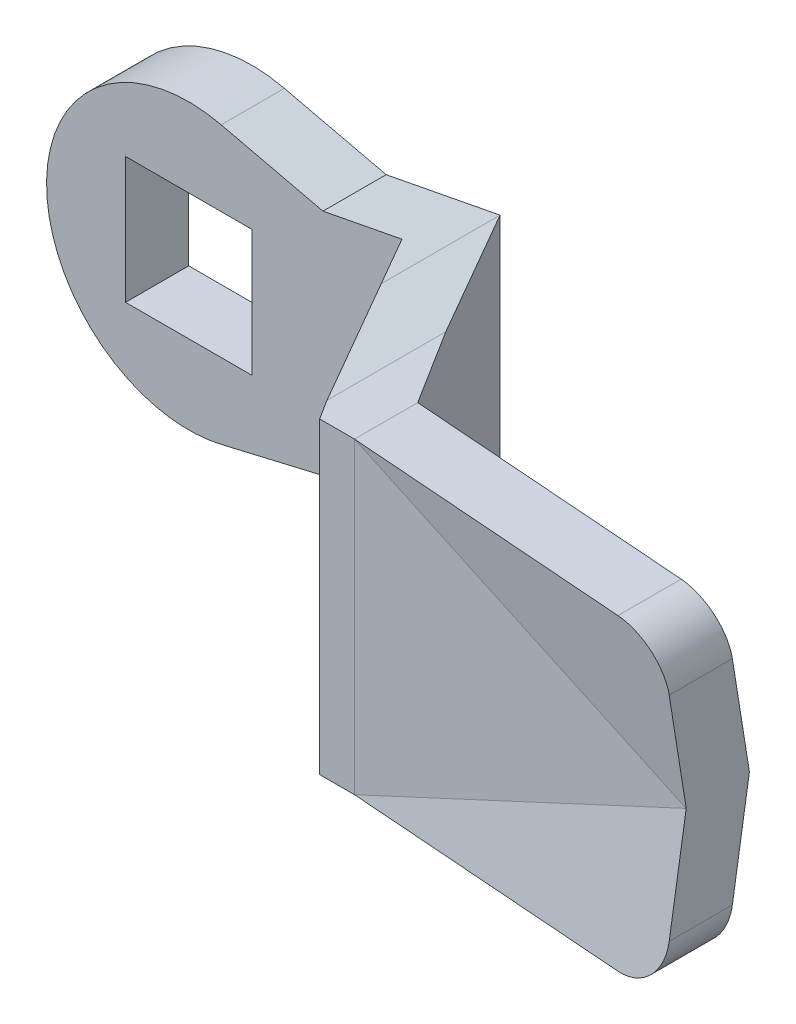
ISO-10303-21;
HEADER;
FILE_DESCRIPTION(('STEP AP214'),'2;1');
FILE_NAME('part.step','',(''),(''),'','','');
FILE_SCHEMA(('AUTOMOTIVE_DESIGN { 1 0 10303 214 1 1 1 1 }'));
ENDSEC;
DATA;
#1=APPLICATION_CONTEXT('core data for automotive mechanical design processes');
#2=APPLICATION_PROTOCOL_DEFINITION('international standard','automotive_design',2000,#1);
#3=PRODUCT_CONTEXT('',#1,'mechanical');
#4=PRODUCT('Part','Part','',(#3));
#5=PRODUCT_RELATED_PRODUCT_CATEGORY('part','',(#4));
#6=PRODUCT_DEFINITION_FORMATION('','',#4);
#7=PRODUCT_DEFINITION_CONTEXT('part definition',#1,'design');
#8=PRODUCT_DEFINITION('design','',#6,#7);
#9=PRODUCT_DEFINITION_SHAPE('','',#8);
#10=(LENGTH_UNIT() NAMED_UNIT(*) SI_UNIT(.MILLI.,.METRE.));
#11=(NAMED_UNIT(*) PLANE_ANGLE_UNIT() SI_UNIT($,.RADIAN.));
#12=(NAMED_UNIT(*) SI_UNIT($,.STERADIAN.) SOLID_ANGLE_UNIT());
#13=UNCERTAINTY_MEASURE_WITH_UNIT(LENGTH_MEASURE(1.E-05),#10,'distance_accuracy_value','');
#14=(GEOMETRIC_REPRESENTATION_CONTEXT(3) GLOBAL_UNCERTAINTY_ASSIGNED_CONTEXT((#13)) GLOBAL_UNIT_ASSIGNED_CONTEXT((#10,
#11,#12)) REPRESENTATION_CONTEXT('',''));
#15=CARTESIAN_POINT('',(0.,0.,0.));
#16=DIRECTION('',(0.,0.,1.));
#17=DIRECTION('',(1.,0.,0.));
#18=AXIS2_PLACEMENT_3D('',#15,#16,#17);
#19=CARTESIAN_POINT('',(23.394059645,15.,18.));
#20=DIRECTION('',(0.,0.,1.));
#21=DIRECTION('',(1.,0.,0.));
#22=AXIS2_PLACEMENT_3D('',#19,#20,#21);
#23=PLANE('',#22);
#24=CARTESIAN_POINT('',(24.5,9.75,18.));
#25=DIRECTION('',(-1.,0.,0.));
#26=VECTOR('',#25,1.);
#27=LINE('',#24,#26);
#28=CARTESIAN_POINT('',(24.5,9.75,18.));
#29=VERTEX_POINT('',#28);
#30=CARTESIAN_POINT('',(22.28811929,9.75,18.));
#31=VERTEX_POINT('',#30);
#32=EDGE_CURVE('E186',#29,#31,#27,.T.);
#33=ORIENTED_EDGE('',*,*,#32,.T.);
#34=CARTESIAN_POINT('',(22.28811929,-9.75,18.));
#35=DIRECTION('',(0.,1.,0.));
#36=VECTOR('',#35,1.);
#37=LINE('',#34,#36);
#38=CARTESIAN_POINT('',(22.28811929,-9.75,18.));
#39=VERTEX_POINT('',#38);
#40=EDGE_CURVE('E202',#39,#31,#37,.T.);
#41=ORIENTED_EDGE('',*,*,#40,.F.);
#42=CARTESIAN_POINT('',(22.28811929,-9.75,18.));
#43=DIRECTION('',(1.,0.,0.));
#44=VECTOR('',#43,1.);
#45=LINE('',#42,#44);
#46=CARTESIAN_POINT('',(24.5,-9.75,18.));
#47=VERTEX_POINT('',#46);
#48=EDGE_CURVE('E189',#39,#47,#45,.T.);
#49=ORIENTED_EDGE('',*,*,#48,.T.);
#50=CARTESIAN_POINT('',(24.5,9.75,18.));
#51=DIRECTION('',(0.,-1.,0.));
#52=VECTOR('',#51,1.);
#53=LINE('',#50,#52);
#54=EDGE_CURVE('E902',#29,#47,#53,.T.);
#55=ORIENTED_EDGE('',*,*,#54,.F.);
#56=EDGE_LOOP('',(#33,#41,#49,#55));
#57=FACE_BOUND('',#56,.T.);
#58=ADVANCED_FACE('F16',(#57),#23,.T.);
#59=CARTESIAN_POINT('',(24.5,-9.75,-30.));
#60=DIRECTION('',(0.,1.,0.));
#61=DIRECTION('',(1.,0.,0.));
#62=AXIS2_PLACEMENT_3D('',#59,#60,#61);
#63=PLANE('',#62);
#64=CARTESIAN_POINT('',(21.5,-9.75,16.744478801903));
#65=DIRECTION('',(0.,0.,-1.));
#66=VECTOR('',#65,1.);
#67=LINE('',#64,#66);
#68=CARTESIAN_POINT('',(21.5,-9.75,16.744478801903));
#69=VERTEX_POINT('',#68);
#70=CARTESIAN_POINT('',(21.5,-9.75,9.22082044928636));
#71=VERTEX_POINT('',#70);
#72=EDGE_CURVE('E216',#69,#71,#67,.T.);
#73=ORIENTED_EDGE('',*,*,#72,.T.);
#74=CARTESIAN_POINT('',(24.5,-9.75,14.));
#75=DIRECTION('',(-0.531656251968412,0.,-0.84696022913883));
#76=VECTOR('',#75,1.);
#77=LINE('',#74,#76);
#78=CARTESIAN_POINT('',(24.5,-9.75,14.));
#79=VERTEX_POINT('',#78);
#80=EDGE_CURVE('E779',#79,#71,#77,.T.);
#81=ORIENTED_EDGE('',*,*,#80,.F.);
#82=CARTESIAN_POINT('',(24.5,-9.75,18.));
#83=DIRECTION('',(0.,0.,-1.));
#84=VECTOR('',#83,1.);
#85=LINE('',#82,#84);
#86=EDGE_CURVE('E51',#47,#79,#85,.T.);
#87=ORIENTED_EDGE('',*,*,#86,.F.);
#88=ORIENTED_EDGE('',*,*,#48,.F.);
#89=CARTESIAN_POINT('',(21.5,-9.75,16.744478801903));
#90=DIRECTION('',(0.531656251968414,0.,0.846960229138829));
#91=VECTOR('',#90,1.);
#92=LINE('',#89,#91);
#93=EDGE_CURVE('E193',#69,#39,#92,.T.);
#94=ORIENTED_EDGE('',*,*,#93,.F.);
#95=EDGE_LOOP('',(#73,#81,#87,#88,#94));
#96=FACE_BOUND('',#95,.T.);
#97=ADVANCED_FACE('F191',(#96),#63,.F.);
#98=CARTESIAN_POINT('',(24.5,9.75,-30.));
#99=DIRECTION('',(0.,-1.,0.));
#100=DIRECTION('',(0.,0.,-1.));
#101=AXIS2_PLACEMENT_3D('',#98,#99,#100);
#102=PLANE('',#101);
#103=CARTESIAN_POINT('',(21.5,9.75,9.22082044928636));
#104=DIRECTION('',(0.,0.,1.));
#105=VECTOR('',#104,1.);
#106=LINE('',#103,#105);
#107=CARTESIAN_POINT('',(21.5,9.75,9.22082044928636));
#108=VERTEX_POINT('',#107);
#109=CARTESIAN_POINT('',(21.5,9.75,16.744478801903));
#110=VERTEX_POINT('',#109);
#111=EDGE_CURVE('E329',#108,#110,#106,.T.);
#112=ORIENTED_EDGE('',*,*,#111,.T.);
#113=CARTESIAN_POINT('',(22.28811929,9.75,18.));
#114=DIRECTION('',(-0.531656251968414,0.,-0.846960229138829));
#115=VECTOR('',#114,1.);
#116=LINE('',#113,#115);
#117=EDGE_CURVE('E207',#31,#110,#116,.T.);
#118=ORIENTED_EDGE('',*,*,#117,.F.);
#119=ORIENTED_EDGE('',*,*,#32,.F.);
#120=CARTESIAN_POINT('',(24.5,9.75,14.));
#121=DIRECTION('',(0.,0.,1.));
#122=VECTOR('',#121,1.);
#123=LINE('',#120,#122);
#124=CARTESIAN_POINT('',(24.5,9.75,14.));
#125=VERTEX_POINT('',#124);
#126=EDGE_CURVE('E377',#125,#29,#123,.T.);
#127=ORIENTED_EDGE('',*,*,#126,.F.);
#128=CARTESIAN_POINT('',(21.5,9.75,9.22082044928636));
#129=DIRECTION('',(0.531656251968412,0.,0.84696022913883));
#130=VECTOR('',#129,1.);
#131=LINE('',#128,#130);
#132=EDGE_CURVE('E414',#108,#125,#131,.T.);
#133=ORIENTED_EDGE('',*,*,#132,.F.);
#134=EDGE_LOOP('',(#112,#118,#119,#127,#133));
#135=FACE_BOUND('',#134,.T.);
#136=ADVANCED_FACE('F344',(#135),#102,.F.);
#137=CARTESIAN_POINT('',(18.605940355,9.19345007,-30.));
#138=DIRECTION('',(0.188847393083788,-0.982006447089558,0.));
#139=DIRECTION('',(0.,0.,-1.));
#140=AXIS2_PLACEMENT_3D('',#137,#138,#139);
#141=PLANE('',#140);
#142=CARTESIAN_POINT('',(15.71188071,8.63690014,7.52365835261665));
#143=DIRECTION('',(0.,0.,-1.));
#144=VECTOR('',#143,1.);
#145=LINE('',#142,#144);
#146=CARTESIAN_POINT('',(15.71188071,8.63690014,7.52365835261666));
#147=VERTEX_POINT('',#146);
#148=CARTESIAN_POINT('',(15.71188071,8.63690014,0.));
#149=VERTEX_POINT('',#148);
#150=EDGE_CURVE('E1118',#147,#149,#145,.T.);
#151=ORIENTED_EDGE('',*,*,#150,.F.);
#152=CARTESIAN_POINT('',(21.5,9.75,16.744478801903));
#153=DIRECTION('',(-0.528899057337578,-0.101711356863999,-0.842567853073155));
#154=VECTOR('',#153,1.);
#155=LINE('',#152,#154);
#156=EDGE_CURVE('E823',#110,#147,#155,.T.);
#157=ORIENTED_EDGE('',*,*,#156,.F.);
#158=ORIENTED_EDGE('',*,*,#111,.F.);
#159=CARTESIAN_POINT('',(15.71188071,8.63690014,0.));
#160=DIRECTION('',(0.528899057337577,0.101711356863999,0.842567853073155));
#161=VECTOR('',#160,1.);
#162=LINE('',#159,#161);
#163=EDGE_CURVE('E364',#149,#108,#162,.T.);
#164=ORIENTED_EDGE('',*,*,#163,.F.);
#165=EDGE_LOOP('',(#151,#157,#158,#164));
#166=FACE_BOUND('',#165,.T.);
#167=ADVANCED_FACE('F335',(#166),#141,.F.);
#168=CARTESIAN_POINT('',(18.605940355,-9.19345007,-30.));
#169=DIRECTION('',(0.188847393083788,0.982006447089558,0.));
#170=DIRECTION('',(0.,0.,-1.));
#171=AXIS2_PLACEMENT_3D('',#168,#169,#170);
#172=PLANE('',#171);
#173=CARTESIAN_POINT('',(15.7118807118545,-8.63690013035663,0.));
#174=DIRECTION('',(0.,0.,1.));
#175=VECTOR('',#174,1.);
#176=LINE('',#173,#175);
#177=CARTESIAN_POINT('',(15.7118807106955,-8.63690013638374,0.));
#178=VERTEX_POINT('',#177);
#179=CARTESIAN_POINT('',(15.7118807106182,-8.63690013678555,7.52365835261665));
#180=VERTEX_POINT('',#179);
#181=EDGE_CURVE('E308',#178,#180,#176,.T.);
#182=ORIENTED_EDGE('',*,*,#181,.F.);
#183=CARTESIAN_POINT('',(21.5,-9.75,9.22082044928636));
#184=DIRECTION('',(-0.528899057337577,0.101711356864,-0.842567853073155));
#185=VECTOR('',#184,1.);
#186=LINE('',#183,#185);
#187=EDGE_CURVE('E297',#71,#178,#186,.T.);
#188=ORIENTED_EDGE('',*,*,#187,.F.);
#189=ORIENTED_EDGE('',*,*,#72,.F.);
#190=CARTESIAN_POINT('',(15.71188071,-8.63690014,7.52365835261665));
#191=DIRECTION('',(0.528899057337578,-0.101711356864,0.842567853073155));
#192=VECTOR('',#191,1.);
#193=LINE('',#190,#192);
#194=EDGE_CURVE('E213',#180,#69,#193,.T.);
#195=ORIENTED_EDGE('',*,*,#194,.F.);
#196=EDGE_LOOP('',(#182,#188,#189,#195));
#197=FACE_BOUND('',#196,.T.);
#198=ADVANCED_FACE('F236',(#197),#172,.F.);
#199=CARTESIAN_POINT('',(17.894059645,15.,11.));
#200=DIRECTION('',(-0.84696022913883,0.,0.531656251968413));
#201=DIRECTION('',(0.,1.,0.));
#202=AXIS2_PLACEMENT_3D('',#199,#200,#201);
#203=PLANE('',#202);
#204=CARTESIAN_POINT('',(15.7118807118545,-8.63690013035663,7.52365835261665));
#205=DIRECTION('',(-0.528899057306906,0.101711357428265,-0.842567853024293));
#206=VECTOR('',#205,1.);
#207=LINE('',#204,#206);
#208=CARTESIAN_POINT('',(13.5000000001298,-8.21153845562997,3.99999999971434));
#209=VERTEX_POINT('',#208);
#210=EDGE_CURVE('E1059',#180,#209,#207,.T.);
#211=ORIENTED_EDGE('',*,*,#210,.F.);
#212=ORIENTED_EDGE('',*,*,#194,.T.);
#213=ORIENTED_EDGE('',*,*,#93,.T.);
#214=ORIENTED_EDGE('',*,*,#40,.T.);
#215=ORIENTED_EDGE('',*,*,#117,.T.);
#216=ORIENTED_EDGE('',*,*,#156,.T.);
#217=CARTESIAN_POINT('',(13.5,8.21153846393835,4.));
#218=DIRECTION('',(0.528899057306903,0.101711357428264,0.842567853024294));
#219=VECTOR('',#218,1.);
#220=LINE('',#217,#219);
#221=CARTESIAN_POINT('',(13.5,8.21153846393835,4.));
#222=VERTEX_POINT('',#221);
#223=EDGE_CURVE('E1124',#222,#147,#220,.T.);
#224=ORIENTED_EDGE('',*,*,#223,.F.);
#225=CARTESIAN_POINT('',(13.5,-8.21153845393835,4.));
#226=DIRECTION('',(0.,1.,0.));
#227=VECTOR('',#226,1.);
#228=LINE('',#225,#227);
#229=EDGE_CURVE('E667',#209,#222,#228,.T.);
#230=ORIENTED_EDGE('',*,*,#229,.F.);
#231=EDGE_LOOP('',(#211,#212,#213,#214,#215,#216,#224,#230));
#232=FACE_BOUND('',#231,.T.);
#233=ADVANCED_FACE('F212',(#232),#203,.T.);
#234=CARTESIAN_POINT('',(4.93826795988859,2.68955124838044E-09,4.));
#235=DIRECTION('',(0.,0.,1.));
#236=DIRECTION('',(1.,0.,0.));
#237=AXIS2_PLACEMENT_3D('',#234,#235,#236);
#238=PLANE('',#237);
#239=CARTESIAN_POINT('',(4.,4.,4.));
#240=DIRECTION('',(-1.,0.,0.));
#241=VECTOR('',#240,1.);
#242=LINE('',#239,#241);
#243=CARTESIAN_POINT('',(4.,4.,4.));
#244=VERTEX_POINT('',#243);
#245=CARTESIAN_POINT('',(-4.,4.,4.));
#246=VERTEX_POINT('',#245);
#247=EDGE_CURVE('E605',#244,#246,#242,.T.);
#248=ORIENTED_EDGE('',*,*,#247,.F.);
#249=CARTESIAN_POINT('',(4.,-4.,4.));
#250=DIRECTION('',(0.,1.,0.));
#251=VECTOR('',#250,1.);
#252=LINE('',#249,#251);
#253=CARTESIAN_POINT('',(4.,-4.,4.));
#254=VERTEX_POINT('',#253);
#255=EDGE_CURVE('E776',#254,#244,#252,.T.);
#256=ORIENTED_EDGE('',*,*,#255,.F.);
#257=CARTESIAN_POINT('',(-4.,-4.,4.));
#258=DIRECTION('',(1.,0.,0.));
#259=VECTOR('',#258,1.);
#260=LINE('',#257,#259);
#261=CARTESIAN_POINT('',(-4.,-4.,4.));
#262=VERTEX_POINT('',#261);
#263=EDGE_CURVE('E514',#262,#254,#260,.T.);
#264=ORIENTED_EDGE('',*,*,#263,.F.);
#265=CARTESIAN_POINT('',(-4.,4.,4.));
#266=DIRECTION('',(0.,-1.,0.));
#267=VECTOR('',#266,1.);
#268=LINE('',#265,#267);
#269=EDGE_CURVE('E759',#246,#262,#268,.T.);
#270=ORIENTED_EDGE('',*,*,#269,.F.);
#271=EDGE_LOOP('',(#248,#256,#264,#270));
#272=FACE_BOUND('',#271,.T.);
#273=CARTESIAN_POINT('',(8.5,-7.24999999,4.));
#274=DIRECTION('',(-0.973559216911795,-0.22843478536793,0.));
#275=VECTOR('',#274,1.);
#276=LINE('',#273,#275);
#277=CARTESIAN_POINT('',(8.5,-7.24999999,4.));
#278=VERTEX_POINT('',#277);
#279=CARTESIAN_POINT('',(2.05591307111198,-8.76203294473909,4.));
#280=VERTEX_POINT('',#279);
#281=EDGE_CURVE('E726',#278,#280,#276,.T.);
#282=ORIENTED_EDGE('',*,*,#281,.F.);
#283=CARTESIAN_POINT('',(13.5,-8.21153845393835,4.));
#284=DIRECTION('',(-0.982006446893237,0.188847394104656,0.));
#285=VECTOR('',#284,1.);
#286=LINE('',#283,#285);
#287=EDGE_CURVE('E738',#209,#278,#286,.T.);
#288=ORIENTED_EDGE('',*,*,#287,.F.);
#289=ORIENTED_EDGE('',*,*,#229,.T.);
#290=CARTESIAN_POINT('',(8.5,7.25,4.));
#291=DIRECTION('',(0.982006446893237,0.188847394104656,0.));
#292=VECTOR('',#291,1.);
#293=LINE('',#290,#292);
#294=CARTESIAN_POINT('',(8.5,7.25,4.));
#295=VERTEX_POINT('',#294);
#296=EDGE_CURVE('E425',#295,#222,#293,.T.);
#297=ORIENTED_EDGE('',*,*,#296,.F.);
#298=CARTESIAN_POINT('',(2.05591307,8.76203295,4.));
#299=DIRECTION('',(0.973559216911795,-0.22843478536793,0.));
#300=VECTOR('',#299,1.);
#301=LINE('',#298,#300);
#302=CARTESIAN_POINT('',(2.05591307,8.76203295,4.));
#303=VERTEX_POINT('',#302);
#304=EDGE_CURVE('E690',#303,#295,#301,.T.);
#305=ORIENTED_EDGE('',*,*,#304,.F.);
#306=CARTESIAN_POINT('',(-1.43440992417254E-09,0.,4.));
#307=DIRECTION('',(0.,0.,-1.));
#308=DIRECTION('',(-0.22843478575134,-0.973559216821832,0.));
#309=AXIS2_PLACEMENT_3D('',#306,#307,#308);
#310=CIRCLE('',#309,8.99999999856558);
#311=CARTESIAN_POINT('',(-2.05591307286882,-8.76203295,4.));
#312=VERTEX_POINT('',#311);
#313=EDGE_CURVE('E702',#312,#303,#310,.T.);
#314=ORIENTED_EDGE('',*,*,#313,.F.);
#315=CARTESIAN_POINT('',(-1.43440992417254E-09,0.,4.));
#316=DIRECTION('',(0.,0.,-1.));
#317=DIRECTION('',(0.228434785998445,-0.973559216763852,0.));
#318=AXIS2_PLACEMENT_3D('',#315,#316,#317);
#319=CIRCLE('',#318,8.99999999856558);
#320=EDGE_CURVE('E714',#280,#312,#319,.T.);
#321=ORIENTED_EDGE('',*,*,#320,.F.);
#322=EDGE_LOOP('',(#282,#288,#289,#297,#305,#314,#321));
#323=FACE_BOUND('',#322,.T.);
#324=ADVANCED_FACE('F235',(#272,#323),#238,.T.);
#325=CARTESIAN_POINT('',(-4.,0.,3.));
#326=DIRECTION('',(1.,0.,0.));
#327=DIRECTION('',(0.,1.,0.));
#328=AXIS2_PLACEMENT_3D('',#325,#326,#327);
#329=PLANE('',#328);
#330=ORIENTED_EDGE('',*,*,#269,.T.);
#331=CARTESIAN_POINT('',(-4.,-4.,0.));
#332=DIRECTION('',(0.,0.,1.));
#333=VECTOR('',#332,1.);
#334=LINE('',#331,#333);
#335=CARTESIAN_POINT('',(-4.,-4.,0.));
#336=VERTEX_POINT('',#335);
#337=EDGE_CURVE('E503',#336,#262,#334,.T.);
#338=ORIENTED_EDGE('',*,*,#337,.F.);
#339=CARTESIAN_POINT('',(-4.,-4.,0.));
#340=DIRECTION('',(0.,1.,0.));
#341=VECTOR('',#340,1.);
#342=LINE('',#339,#341);
#343=CARTESIAN_POINT('',(-4.,4.,0.));
#344=VERTEX_POINT('',#343);
#345=EDGE_CURVE('E627',#336,#344,#342,.T.);
#346=ORIENTED_EDGE('',*,*,#345,.T.);
#347=CARTESIAN_POINT('',(-4.,4.,4.));
#348=DIRECTION('',(0.,0.,-1.));
#349=VECTOR('',#348,1.);
#350=LINE('',#347,#349);
#351=EDGE_CURVE('E616',#246,#344,#350,.T.);
#352=ORIENTED_EDGE('',*,*,#351,.F.);
#353=EDGE_LOOP('',(#330,#338,#346,#352));
#354=FACE_BOUND('',#353,.T.);
#355=ADVANCED_FACE('F632',(#354),#329,.T.);
#356=CARTESIAN_POINT('',(0.,4.,3.));
#357=DIRECTION('',(0.,-1.,0.));
#358=DIRECTION('',(0.,0.,-1.));
#359=AXIS2_PLACEMENT_3D('',#356,#357,#358);
#360=PLANE('',#359);
#361=ORIENTED_EDGE('',*,*,#247,.T.);
#362=ORIENTED_EDGE('',*,*,#351,.T.);
#363=CARTESIAN_POINT('',(-4.,4.,0.));
#364=DIRECTION('',(1.,0.,0.));
#365=VECTOR('',#364,1.);
#366=LINE('',#363,#365);
#367=CARTESIAN_POINT('',(4.,4.,0.));
#368=VERTEX_POINT('',#367);
#369=EDGE_CURVE('E585',#344,#368,#366,.T.);
#370=ORIENTED_EDGE('',*,*,#369,.T.);
#371=CARTESIAN_POINT('',(4.,4.,4.));
#372=DIRECTION('',(0.,0.,-1.));
#373=VECTOR('',#372,1.);
#374=LINE('',#371,#373);
#375=EDGE_CURVE('E572',#244,#368,#374,.T.);
#376=ORIENTED_EDGE('',*,*,#375,.F.);
#377=EDGE_LOOP('',(#361,#362,#370,#376));
#378=FACE_BOUND('',#377,.T.);
#379=ADVANCED_FACE('F552',(#378),#360,.T.);
#380=CARTESIAN_POINT('',(4.,0.,3.));
#381=DIRECTION('',(-1.,0.,0.));
#382=DIRECTION('',(0.,0.,1.));
#383=AXIS2_PLACEMENT_3D('',#380,#381,#382);
#384=PLANE('',#383);
#385=ORIENTED_EDGE('',*,*,#255,.T.);
#386=ORIENTED_EDGE('',*,*,#375,.T.);
#387=CARTESIAN_POINT('',(4.,4.,0.));
#388=DIRECTION('',(0.,-1.,0.));
#389=VECTOR('',#388,1.);
#390=LINE('',#387,#389);
#391=CARTESIAN_POINT('',(4.,-4.,0.));
#392=VERTEX_POINT('',#391);
#393=EDGE_CURVE('E538',#368,#392,#390,.T.);
#394=ORIENTED_EDGE('',*,*,#393,.T.);
#395=CARTESIAN_POINT('',(4.,-4.,4.));
#396=DIRECTION('',(0.,0.,-1.));
#397=VECTOR('',#396,1.);
#398=LINE('',#395,#397);
#399=EDGE_CURVE('E525',#254,#392,#398,.T.);
#400=ORIENTED_EDGE('',*,*,#399,.F.);
#401=EDGE_LOOP('',(#385,#386,#394,#400));
#402=FACE_BOUND('',#401,.T.);
#403=ADVANCED_FACE('F543',(#402),#384,.T.);
#404=CARTESIAN_POINT('',(0.,-4.,3.));
#405=DIRECTION('',(0.,1.,0.));
#406=DIRECTION('',(1.,0.,0.));
#407=AXIS2_PLACEMENT_3D('',#404,#405,#406);
#408=PLANE('',#407);
#409=ORIENTED_EDGE('',*,*,#263,.T.);
#410=ORIENTED_EDGE('',*,*,#399,.T.);
#411=CARTESIAN_POINT('',(4.,-4.,0.));
#412=DIRECTION('',(-1.,0.,0.));
#413=VECTOR('',#412,1.);
#414=LINE('',#411,#413);
#415=EDGE_CURVE('E491',#392,#336,#414,.T.);
#416=ORIENTED_EDGE('',*,*,#415,.T.);
#417=ORIENTED_EDGE('',*,*,#337,.T.);
#418=EDGE_LOOP('',(#409,#410,#416,#417));
#419=FACE_BOUND('',#418,.T.);
#420=ADVANCED_FACE('F451',(#419),#408,.T.);
#421=CARTESIAN_POINT('',(20.105940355,15.,7.));
#422=DIRECTION('',(0.84696022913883,0.,-0.531656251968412));
#423=DIRECTION('',(0.,-1.,0.));
#424=AXIS2_PLACEMENT_3D('',#421,#422,#423);
#425=PLANE('',#424);
#426=ORIENTED_EDGE('',*,*,#132,.T.);
#427=CARTESIAN_POINT('',(24.5,9.75,14.));
#428=DIRECTION('',(0.,-1.,0.));
#429=VECTOR('',#428,1.);
#430=LINE('',#427,#429);
#431=EDGE_CURVE('E28',#125,#79,#430,.T.);
#432=ORIENTED_EDGE('',*,*,#431,.T.);
#433=ORIENTED_EDGE('',*,*,#80,.T.);
#434=ORIENTED_EDGE('',*,*,#187,.T.);
#435=CARTESIAN_POINT('',(15.71188071,-8.63690014,0.));
#436=DIRECTION('',(0.,1.,0.));
#437=VECTOR('',#436,1.);
#438=LINE('',#435,#437);
#439=EDGE_CURVE('E429',#178,#149,#438,.T.);
#440=ORIENTED_EDGE('',*,*,#439,.T.);
#441=ORIENTED_EDGE('',*,*,#163,.T.);
#442=EDGE_LOOP('',(#426,#432,#433,#434,#440,#441));
#443=FACE_BOUND('',#442,.T.);
#444=ADVANCED_FACE('F427',(#443),#425,.T.);
#445=CARTESIAN_POINT('',(12.105940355,7.94345007,0.));
#446=DIRECTION('',(-0.188847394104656,0.982006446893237,0.));
#447=DIRECTION('',(0.,0.,1.));
#448=AXIS2_PLACEMENT_3D('',#445,#446,#447);
#449=PLANE('',#448);
#450=CARTESIAN_POINT('',(15.71188071,8.63690014,0.));
#451=DIRECTION('',(-0.982006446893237,-0.188847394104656,0.));
#452=VECTOR('',#451,1.);
#453=LINE('',#450,#452);
#454=CARTESIAN_POINT('',(8.5,7.25,0.));
#455=VERTEX_POINT('',#454);
#456=EDGE_CURVE('E1016',#149,#455,#453,.T.);
#457=ORIENTED_EDGE('',*,*,#456,.T.);
#458=CARTESIAN_POINT('',(8.5,7.25,4.));
#459=DIRECTION('',(0.,0.,-1.));
#460=VECTOR('',#459,1.);
#461=LINE('',#458,#460);
#462=EDGE_CURVE('E1106',#295,#455,#461,.T.);
#463=ORIENTED_EDGE('',*,*,#462,.F.);
#464=ORIENTED_EDGE('',*,*,#296,.T.);
#465=ORIENTED_EDGE('',*,*,#223,.T.);
#466=ORIENTED_EDGE('',*,*,#150,.T.);
#467=EDGE_LOOP('',(#457,#463,#464,#465,#466));
#468=FACE_BOUND('',#467,.T.);
#469=ADVANCED_FACE('F450',(#468),#449,.T.);
#470=CARTESIAN_POINT('',(5.277956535,8.006016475,0.));
#471=DIRECTION('',(0.22843478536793,0.973559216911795,0.));
#472=DIRECTION('',(0.,0.,-1.));
#473=AXIS2_PLACEMENT_3D('',#470,#471,#472);
#474=PLANE('',#473);
#475=CARTESIAN_POINT('',(8.5,7.25,0.));
#476=DIRECTION('',(-0.973559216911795,0.22843478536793,0.));
#477=VECTOR('',#476,1.);
#478=LINE('',#475,#477);
#479=CARTESIAN_POINT('',(2.05591307,8.76203295,0.));
#480=VERTEX_POINT('',#479);
#481=EDGE_CURVE('E1010',#455,#480,#478,.T.);
#482=ORIENTED_EDGE('',*,*,#481,.T.);
#483=CARTESIAN_POINT('',(2.05591307,8.76203295,4.));
#484=DIRECTION('',(0.,0.,-1.));
#485=VECTOR('',#484,1.);
#486=LINE('',#483,#485);
#487=EDGE_CURVE('E1094',#303,#480,#486,.T.);
#488=ORIENTED_EDGE('',*,*,#487,.F.);
#489=ORIENTED_EDGE('',*,*,#304,.T.);
#490=ORIENTED_EDGE('',*,*,#462,.T.);
#491=EDGE_LOOP('',(#482,#488,#489,#490));
#492=FACE_BOUND('',#491,.T.);
#493=ADVANCED_FACE('F1511',(#492),#474,.T.);
#494=CARTESIAN_POINT('',(-1.43440992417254E-09,0.,0.));
#495=DIRECTION('',(0.,0.,1.));
#496=DIRECTION('',(0.228434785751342,0.973559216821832,0.));
#497=AXIS2_PLACEMENT_3D('',#494,#495,#496);
#498=CYLINDRICAL_SURFACE('',#497,8.99999999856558);
#499=ORIENTED_EDGE('',*,*,#487,.T.);
#500=CARTESIAN_POINT('',(-1.43440992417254E-09,0.,0.));
#501=DIRECTION('',(0.,0.,1.));
#502=DIRECTION('',(0.228434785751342,0.973559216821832,0.));
#503=AXIS2_PLACEMENT_3D('',#500,#501,#502);
#504=CIRCLE('',#503,8.99999999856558);
#505=CARTESIAN_POINT('',(-2.05591307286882,-8.76203295,0.));
#506=VERTEX_POINT('',#505);
#507=EDGE_CURVE('E1004',#480,#506,#504,.T.);
#508=ORIENTED_EDGE('',*,*,#507,.T.);
#509=CARTESIAN_POINT('',(-2.0559130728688,-8.76203295,4.));
#510=DIRECTION('',(0.,0.,-1.));
#511=VECTOR('',#510,1.);
#512=LINE('',#509,#511);
#513=EDGE_CURVE('E1087',#312,#506,#512,.T.);
#514=ORIENTED_EDGE('',*,*,#513,.F.);
#515=ORIENTED_EDGE('',*,*,#313,.T.);
#516=EDGE_LOOP('',(#499,#508,#514,#515));
#517=FACE_BOUND('',#516,.T.);
#518=ADVANCED_FACE('F1522',(#517),#498,.T.);
#519=CARTESIAN_POINT('',(-1.43440992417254E-09,0.,0.));
#520=DIRECTION('',(0.,0.,1.));
#521=DIRECTION('',(0.228434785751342,0.973559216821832,0.));
#522=AXIS2_PLACEMENT_3D('',#519,#520,#521);
#523=CYLINDRICAL_SURFACE('',#522,8.99999999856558);
#524=CARTESIAN_POINT('',(2.05591307,-8.76203294,4.));
#525=DIRECTION('',(0.,0.,-1.));
#526=VECTOR('',#525,1.);
#527=LINE('',#524,#526);
#528=CARTESIAN_POINT('',(2.05591307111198,-8.76203294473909,0.));
#529=VERTEX_POINT('',#528);
#530=EDGE_CURVE('E1070',#280,#529,#527,.T.);
#531=ORIENTED_EDGE('',*,*,#530,.F.);
#532=ORIENTED_EDGE('',*,*,#320,.T.);
#533=ORIENTED_EDGE('',*,*,#513,.T.);
#534=CARTESIAN_POINT('',(-1.43440992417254E-09,0.,0.));
#535=DIRECTION('',(0.,0.,1.));
#536=DIRECTION('',(-0.22843478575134,-0.973559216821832,0.));
#537=AXIS2_PLACEMENT_3D('',#534,#535,#536);
#538=CIRCLE('',#537,8.99999999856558);
#539=EDGE_CURVE('E998',#506,#529,#538,.T.);
#540=ORIENTED_EDGE('',*,*,#539,.T.);
#541=EDGE_LOOP('',(#531,#532,#533,#540));
#542=FACE_BOUND('',#541,.T.);
#543=ADVANCED_FACE('F1533',(#542),#523,.T.);
#544=CARTESIAN_POINT('',(5.277956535,-8.006016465,0.));
#545=DIRECTION('',(0.22843478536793,-0.973559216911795,0.));
#546=DIRECTION('',(0.,0.,-1.));
#547=AXIS2_PLACEMENT_3D('',#544,#545,#546);
#548=PLANE('',#547);
#549=CARTESIAN_POINT('',(2.05591307,-8.76203294,0.));
#550=DIRECTION('',(0.973559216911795,0.22843478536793,0.));
#551=VECTOR('',#550,1.);
#552=LINE('',#549,#551);
#553=CARTESIAN_POINT('',(8.5,-7.24999999,0.));
#554=VERTEX_POINT('',#553);
#555=EDGE_CURVE('E992',#529,#554,#552,.T.);
#556=ORIENTED_EDGE('',*,*,#555,.T.);
#557=CARTESIAN_POINT('',(8.5,-7.24999999,4.));
#558=DIRECTION('',(0.,0.,-1.));
#559=VECTOR('',#558,1.);
#560=LINE('',#557,#559);
#561=EDGE_CURVE('E1047',#278,#554,#560,.T.);
#562=ORIENTED_EDGE('',*,*,#561,.F.);
#563=ORIENTED_EDGE('',*,*,#281,.T.);
#564=ORIENTED_EDGE('',*,*,#530,.T.);
#565=EDGE_LOOP('',(#556,#562,#563,#564));
#566=FACE_BOUND('',#565,.T.);
#567=ADVANCED_FACE('F1545',(#566),#548,.T.);
#568=CARTESIAN_POINT('',(12.105940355,-7.94345006,0.));
#569=DIRECTION('',(-0.188847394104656,-0.982006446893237,0.));
#570=DIRECTION('',(-0.982006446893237,0.188847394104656,0.));
#571=AXIS2_PLACEMENT_3D('',#568,#569,#570);
#572=PLANE('',#571);
#573=ORIENTED_EDGE('',*,*,#287,.T.);
#574=ORIENTED_EDGE('',*,*,#561,.T.);
#575=CARTESIAN_POINT('',(8.5,-7.24999999,0.));
#576=DIRECTION('',(0.982006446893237,-0.188847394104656,0.));
#577=VECTOR('',#576,1.);
#578=LINE('',#575,#577);
#579=EDGE_CURVE('E985',#554,#178,#578,.T.);
#580=ORIENTED_EDGE('',*,*,#579,.T.);
#581=ORIENTED_EDGE('',*,*,#181,.T.);
#582=ORIENTED_EDGE('',*,*,#210,.T.);
#583=EDGE_LOOP('',(#573,#574,#580,#581,#582));
#584=FACE_BOUND('',#583,.T.);
#585=ADVANCED_FACE('F1557',(#584),#572,.T.);
#586=CARTESIAN_POINT('',(4.93826795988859,2.68955109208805E-09,0.));
#587=DIRECTION('',(0.,0.,1.));
#588=DIRECTION('',(1.,0.,0.));
#589=AXIS2_PLACEMENT_3D('',#586,#587,#588);
#590=PLANE('',#589);
#591=ORIENTED_EDGE('',*,*,#555,.F.);
#592=ORIENTED_EDGE('',*,*,#539,.F.);
#593=ORIENTED_EDGE('',*,*,#507,.F.);
#594=ORIENTED_EDGE('',*,*,#481,.F.);
#595=ORIENTED_EDGE('',*,*,#456,.F.);
#596=ORIENTED_EDGE('',*,*,#439,.F.);
#597=ORIENTED_EDGE('',*,*,#579,.F.);
#598=EDGE_LOOP('',(#591,#592,#593,#594,#595,#596,#597));
#599=FACE_BOUND('',#598,.T.);
#600=ORIENTED_EDGE('',*,*,#393,.F.);
#601=ORIENTED_EDGE('',*,*,#369,.F.);
#602=ORIENTED_EDGE('',*,*,#345,.F.);
#603=ORIENTED_EDGE('',*,*,#415,.F.);
#604=EDGE_LOOP('',(#600,#601,#602,#603));
#605=FACE_BOUND('',#604,.T.);
#606=CARTESIAN_POINT('',(11.5,-3.,0.));
#607=DIRECTION('',(0.,1.,0.));
#608=VECTOR('',#607,1.);
#609=LINE('',#606,#608);
#610=CARTESIAN_POINT('',(11.5,-3.,0.));
#611=VERTEX_POINT('',#610);
#612=CARTESIAN_POINT('',(11.5,3.,0.));
#613=VERTEX_POINT('',#612);
#614=EDGE_CURVE('E947',#611,#613,#609,.T.);
#615=ORIENTED_EDGE('',*,*,#614,.T.);
#616=CARTESIAN_POINT('',(11.5,3.,0.));
#617=DIRECTION('',(-1.,0.,0.));
#618=VECTOR('',#617,1.);
#619=LINE('',#616,#618);
#620=CARTESIAN_POINT('',(6.5,3.,0.));
#621=VERTEX_POINT('',#620);
#622=EDGE_CURVE('E979',#613,#621,#619,.T.);
#623=ORIENTED_EDGE('',*,*,#622,.T.);
#624=CARTESIAN_POINT('',(6.5,3.,0.));
#625=DIRECTION('',(0.,-1.,0.));
#626=VECTOR('',#625,1.);
#627=LINE('',#624,#626);
#628=CARTESIAN_POINT('',(6.5,-3.,0.));
#629=VERTEX_POINT('',#628);
#630=EDGE_CURVE('E973',#621,#629,#627,.T.);
#631=ORIENTED_EDGE('',*,*,#630,.T.);
#632=CARTESIAN_POINT('',(6.5,-3.,0.));
#633=DIRECTION('',(1.,0.,0.));
#634=VECTOR('',#633,1.);
#635=LINE('',#632,#634);
#636=EDGE_CURVE('E960',#629,#611,#635,.T.);
#637=ORIENTED_EDGE('',*,*,#636,.T.);
#638=EDGE_LOOP('',(#615,#623,#631,#637));
#639=FACE_BOUND('',#638,.T.);
#640=ADVANCED_FACE('F1569',(#599,#605,#639),#590,.F.);
#641=CARTESIAN_POINT('',(9.,3.,-1.25));
#642=DIRECTION('',(0.,-1.,0.));
#643=DIRECTION('',(0.,0.,-1.));
#644=AXIS2_PLACEMENT_3D('',#641,#642,#643);
#645=PLANE('',#644);
#646=CARTESIAN_POINT('',(11.5,3.,-2.5));
#647=DIRECTION('',(-1.,0.,0.));
#648=VECTOR('',#647,1.);
#649=LINE('',#646,#648);
#650=CARTESIAN_POINT('',(11.5,3.,-2.5));
#651=VERTEX_POINT('',#650);
#652=CARTESIAN_POINT('',(6.5,3.,-2.5));
#653=VERTEX_POINT('',#652);
#654=EDGE_CURVE('E928',#651,#653,#649,.T.);
#655=ORIENTED_EDGE('',*,*,#654,.T.);
#656=CARTESIAN_POINT('',(6.5,3.,-2.5));
#657=DIRECTION('',(0.,0.,1.));
#658=VECTOR('',#657,1.);
#659=LINE('',#656,#658);
#660=EDGE_CURVE('E966',#653,#621,#659,.T.);
#661=ORIENTED_EDGE('',*,*,#660,.T.);
#662=ORIENTED_EDGE('',*,*,#622,.F.);
#663=CARTESIAN_POINT('',(11.5,3.,0.));
#664=DIRECTION('',(0.,0.,-1.));
#665=VECTOR('',#664,1.);
#666=LINE('',#663,#665);
#667=EDGE_CURVE('E941',#613,#651,#666,.T.);
#668=ORIENTED_EDGE('',*,*,#667,.T.);
#669=EDGE_LOOP('',(#655,#661,#662,#668));
#670=FACE_BOUND('',#669,.T.);
#671=ADVANCED_FACE('F1581',(#670),#645,.F.);
#672=CARTESIAN_POINT('',(6.5,0.,-1.25));
#673=DIRECTION('',(1.,0.,0.));
#674=DIRECTION('',(0.,1.,0.));
#675=AXIS2_PLACEMENT_3D('',#672,#673,#674);
#676=PLANE('',#675);
#677=CARTESIAN_POINT('',(6.5,3.,-2.5));
#678=DIRECTION('',(0.,-1.,0.));
#679=VECTOR('',#678,1.);
#680=LINE('',#677,#679);
#681=CARTESIAN_POINT('',(6.5,-3.,-2.5));
#682=VERTEX_POINT('',#681);
#683=EDGE_CURVE('E922',#653,#682,#680,.T.);
#684=ORIENTED_EDGE('',*,*,#683,.T.);
#685=CARTESIAN_POINT('',(6.5,-3.,-2.5));
#686=DIRECTION('',(0.,0.,1.));
#687=VECTOR('',#686,1.);
#688=LINE('',#685,#687);
#689=EDGE_CURVE('E953',#682,#629,#688,.T.);
#690=ORIENTED_EDGE('',*,*,#689,.T.);
#691=ORIENTED_EDGE('',*,*,#630,.F.);
#692=ORIENTED_EDGE('',*,*,#660,.F.);
#693=EDGE_LOOP('',(#684,#690,#691,#692));
#694=FACE_BOUND('',#693,.T.);
#695=ADVANCED_FACE('F1593',(#694),#676,.F.);
#696=CARTESIAN_POINT('',(9.,-3.,-1.25));
#697=DIRECTION('',(0.,1.,0.));
#698=DIRECTION('',(1.,0.,0.));
#699=AXIS2_PLACEMENT_3D('',#696,#697,#698);
#700=PLANE('',#699);
#701=CARTESIAN_POINT('',(6.5,-3.,-2.5));
#702=DIRECTION('',(1.,0.,0.));
#703=VECTOR('',#702,1.);
#704=LINE('',#701,#703);
#705=CARTESIAN_POINT('',(11.5,-3.,-2.5));
#706=VERTEX_POINT('',#705);
#707=EDGE_CURVE('E916',#682,#706,#704,.T.);
#708=ORIENTED_EDGE('',*,*,#707,.T.);
#709=CARTESIAN_POINT('',(11.5,-3.,-2.5));
#710=DIRECTION('',(0.,0.,1.));
#711=VECTOR('',#710,1.);
#712=LINE('',#709,#711);
#713=EDGE_CURVE('E934',#706,#611,#712,.T.);
#714=ORIENTED_EDGE('',*,*,#713,.T.);
#715=ORIENTED_EDGE('',*,*,#636,.F.);
#716=ORIENTED_EDGE('',*,*,#689,.F.);
#717=EDGE_LOOP('',(#708,#714,#715,#716));
#718=FACE_BOUND('',#717,.T.);
#719=ADVANCED_FACE('F1605',(#718),#700,.F.);
#720=CARTESIAN_POINT('',(11.5,0.,-1.25));
#721=DIRECTION('',(-1.,0.,0.));
#722=DIRECTION('',(0.,0.,1.));
#723=AXIS2_PLACEMENT_3D('',#720,#721,#722);
#724=PLANE('',#723);
#725=CARTESIAN_POINT('',(11.5,-3.,-2.5));
#726=DIRECTION('',(0.,1.,0.));
#727=VECTOR('',#726,1.);
#728=LINE('',#725,#727);
#729=EDGE_CURVE('E906',#706,#651,#728,.T.);
#730=ORIENTED_EDGE('',*,*,#729,.T.);
#731=ORIENTED_EDGE('',*,*,#667,.F.);
#732=ORIENTED_EDGE('',*,*,#614,.F.);
#733=ORIENTED_EDGE('',*,*,#713,.F.);
#734=EDGE_LOOP('',(#730,#731,#732,#733));
#735=FACE_BOUND('',#734,.T.);
#736=ADVANCED_FACE('F1617',(#735),#724,.F.);
#737=CARTESIAN_POINT('',(9.,0.,-2.5));
#738=DIRECTION('',(0.,0.,1.));
#739=DIRECTION('',(1.,0.,0.));
#740=AXIS2_PLACEMENT_3D('',#737,#738,#739);
#741=PLANE('',#740);
#742=ORIENTED_EDGE('',*,*,#707,.F.);
#743=ORIENTED_EDGE('',*,*,#683,.F.);
#744=ORIENTED_EDGE('',*,*,#654,.F.);
#745=ORIENTED_EDGE('',*,*,#729,.F.);
#746=EDGE_LOOP('',(#742,#743,#744,#745));
#747=FACE_BOUND('',#746,.T.);
#748=ADVANCED_FACE('F1629',(#747),#741,.F.);
#749=CARTESIAN_POINT('',(36.,0.,18.));
#750=DIRECTION('',(0.,0.,1.));
#751=DIRECTION('',(1.,0.,0.));
#752=AXIS2_PLACEMENT_3D('',#749,#750,#751);
#753=PLANE('',#752);
#754=CARTESIAN_POINT('',(24.5,9.75000000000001,18.));
#755=DIRECTION('',(0.907008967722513,-0.421111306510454,0.));
#756=VECTOR('',#755,1.);
#757=LINE('',#754,#756);
#758=CARTESIAN_POINT('',(45.499999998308,0.,18.0000000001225));
#759=VERTEX_POINT('',#758);
#760=EDGE_CURVE('E905',#29,#759,#757,.T.);
#761=ORIENTED_EDGE('',*,*,#760,.F.);
#762=ORIENTED_EDGE('',*,*,#54,.T.);
#763=CARTESIAN_POINT('',(45.4999999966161,0.,18.));
#764=DIRECTION('',(-0.907008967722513,-0.421111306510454,0.));
#765=VECTOR('',#764,1.);
#766=LINE('',#763,#765);
#767=EDGE_CURVE('E1673',#759,#47,#766,.T.);
#768=ORIENTED_EDGE('',*,*,#767,.F.);
#769=EDGE_LOOP('',(#761,#762,#768));
#770=FACE_BOUND('',#769,.T.);
#771=ADVANCED_FACE('F1641',(#770),#753,.T.);
#772=CARTESIAN_POINT('',(39.2716939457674,8.32058902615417,18.8682408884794));
#773=DIRECTION('',(-0.0731252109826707,-0.157500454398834,0.984807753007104));
#774=DIRECTION('',(-0.907008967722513,0.421111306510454,0.));
#775=AXIS2_PLACEMENT_3D('',#772,#773,#774);
#776=PLANE('',#775);
#777=CARTESIAN_POINT('',(45.5,6.75,19.0795285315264));
#778=DIRECTION('',(0.,-0.987451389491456,-0.157923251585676));
#779=VECTOR('',#778,1.);
#780=LINE('',#777,#779);
#781=CARTESIAN_POINT('',(45.5,6.75,19.0795285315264));
#782=VERTEX_POINT('',#781);
#783=EDGE_CURVE('E1830',#782,#759,#780,.T.);
#784=ORIENTED_EDGE('',*,*,#783,.F.);
#785=CARTESIAN_POINT('',(42.51511117,9.75000000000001,19.3376811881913));
#786=CARTESIAN_POINT('',(42.5479097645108,9.74991721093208,19.340103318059));
#787=CARTESIAN_POINT('',(42.5807137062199,9.7492947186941,19.3424347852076));
#788=CARTESIAN_POINT('',(42.6462692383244,9.74697171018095,19.3469140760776));
#789=CARTESIAN_POINT('',(42.6790208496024,9.74527206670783,19.3490620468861));
#790=CARTESIAN_POINT('',(42.744436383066,9.74079774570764,19.3531743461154));
#791=CARTESIAN_POINT('',(42.7771003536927,9.73802390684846,19.355138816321));
#792=CARTESIAN_POINT('',(42.8423054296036,9.73140568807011,19.3588841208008));
#793=CARTESIAN_POINT('',(42.8748466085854,9.72756211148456,19.3606650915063));
#794=CARTESIAN_POINT('',(42.9397711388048,9.71880996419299,19.3640434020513));
#795=CARTESIAN_POINT('',(42.9721545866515,9.71390216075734,19.3656408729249));
#796=CARTESIAN_POINT('',(43.0367289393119,9.70302826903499,19.3686521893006));
#797=CARTESIAN_POINT('',(43.0689199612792,9.69706291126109,19.370066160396));
#798=CARTESIAN_POINT('',(43.1330750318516,9.68408174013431,19.3727104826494));
#799=CARTESIAN_POINT('',(43.1650392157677,9.67706661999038,19.3739409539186));
#800=CARTESIAN_POINT('',(43.2287065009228,9.66199486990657,19.3762182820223));
#801=CARTESIAN_POINT('',(43.2604097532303,9.65393889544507,19.3772652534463));
#802=CARTESIAN_POINT('',(43.323521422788,9.63679548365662,19.3791755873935));
#803=CARTESIAN_POINT('',(43.3549300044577,9.62770866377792,19.3800390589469));
#804=CARTESIAN_POINT('',(43.4174189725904,9.60851469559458,19.3815823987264));
#805=CARTESIAN_POINT('',(43.4484995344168,9.59840812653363,19.3822623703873));
#806=CARTESIAN_POINT('',(43.5102995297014,9.57718686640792,19.3834387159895));
#807=CARTESIAN_POINT('',(43.5410191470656,9.56607271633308,19.383935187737));
#808=CARTESIAN_POINT('',(43.6020647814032,9.54284955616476,19.3847445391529));
#809=CARTESIAN_POINT('',(43.6323909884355,9.53074104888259,19.3850575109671));
#810=CARTESIAN_POINT('',(43.6926178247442,9.50554347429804,19.3854998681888));
#811=CARTESIAN_POINT('',(43.7225186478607,9.49245487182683,19.3856293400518));
#812=CARTESIAN_POINT('',(43.7818632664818,9.46531242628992,19.3857047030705));
#813=CARTESIAN_POINT('',(43.8113072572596,9.45125901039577,19.3856506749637));
#814=CARTESIAN_POINT('',(43.8697073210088,9.42220325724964,19.3853590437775));
#815=CARTESIAN_POINT('',(43.8986635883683,9.40720130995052,19.3851215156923));
#816=CARTESIAN_POINT('',(43.9560579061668,9.37626579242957,19.3844628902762));
#817=CARTESIAN_POINT('',(43.9844961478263,9.3603325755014,19.3840418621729));
#818=CARTESIAN_POINT('',(44.0408247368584,9.327552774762,19.3830162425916));
#819=CARTESIAN_POINT('',(44.0687152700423,9.31070650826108,19.3824117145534));
#820=CARTESIAN_POINT('',(44.123919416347,9.27611979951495,19.3810191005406));
#821=CARTESIAN_POINT('',(44.1512332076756,9.25837963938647,19.3802310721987));
#822=CARTESIAN_POINT('',(44.2052555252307,9.22202524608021,19.378471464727));
#823=CARTESIAN_POINT('',(44.2319642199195,9.20341126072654,19.3774999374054));
#824=CARTESIAN_POINT('',(44.2847487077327,9.16533020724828,19.3753733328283));
#825=CARTESIAN_POINT('',(44.3108246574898,9.14586335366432,19.3742183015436));
#826=CARTESIAN_POINT('',(44.3623167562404,9.10609841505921,19.3717247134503));
#827=CARTESIAN_POINT('',(44.3877330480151,9.08580051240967,19.3703861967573));
#828=CARTESIAN_POINT('',(44.4378796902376,9.04439616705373,19.3675255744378));
#829=CARTESIAN_POINT('',(44.462610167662,9.02328987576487,19.3660035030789));
#830=CARTESIAN_POINT('',(44.511359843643,8.98029223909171,19.3627760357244));
#831=CARTESIAN_POINT('',(44.5353791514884,8.95840101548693,19.3610706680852));
#832=CARTESIAN_POINT('',(44.5826819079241,8.91385783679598,19.3574756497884));
#833=CARTESIAN_POINT('',(44.6059654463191,8.89120597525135,19.3555860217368));
#834=CARTESIAN_POINT('',(44.651884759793,8.84505419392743,19.3516164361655));
#835=CARTESIAN_POINT('',(44.6745169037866,8.82155073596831,19.3495356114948));
#836=CARTESIAN_POINT('',(44.7191653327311,8.77363999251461,19.3451823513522));
#837=CARTESIAN_POINT('',(44.7411754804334,8.74922711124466,19.3429085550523));
#838=CARTESIAN_POINT('',(44.7845385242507,8.69950794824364,19.3381683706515));
#839=CARTESIAN_POINT('',(44.8058850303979,8.67419622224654,19.3357006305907));
#840=CARTESIAN_POINT('',(44.8478791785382,8.62269159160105,19.3305728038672));
#841=CARTESIAN_POINT('',(44.86852018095,8.59649340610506,19.3279113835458));
#842=CARTESIAN_POINT('',(44.9090614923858,8.54322999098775,19.3223961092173));
#843=CARTESIAN_POINT('',(44.928954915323,8.51615965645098,19.3195409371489));
#844=CARTESIAN_POINT('',(44.9679591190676,8.46116801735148,19.3136381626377));
#845=CARTESIAN_POINT('',(44.9870627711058,8.43324179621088,19.310589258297));
#846=CARTESIAN_POINT('',(45.0244454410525,8.37655644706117,19.304298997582));
#847=CARTESIAN_POINT('',(45.0427170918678,8.34779260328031,19.3010563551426));
#848=CARTESIAN_POINT('',(45.0783938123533,8.28945209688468,19.2943786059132));
#849=CARTESIAN_POINT('',(45.0957912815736,8.25987093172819,19.2909422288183));
#850=CARTESIAN_POINT('',(45.1296778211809,8.19991794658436,19.2838769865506));
#851=CARTESIAN_POINT('',(45.1461590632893,8.16954184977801,19.2802468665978));
#852=CARTESIAN_POINT('',(45.178171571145,8.10802322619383,19.2727941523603));
#853=CARTESIAN_POINT('',(45.1936947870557,8.07687666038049,19.2689703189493));
#854=CARTESIAN_POINT('',(45.2237499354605,8.01384360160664,19.2611300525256));
#855=CARTESIAN_POINT('',(45.2382736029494,7.98195332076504,19.257112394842));
#856=CARTESIAN_POINT('',(45.2662889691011,7.91746093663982,19.2488848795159));
#857=CARTESIAN_POINT('',(45.2797721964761,7.88485530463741,19.2446738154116));
#858=CARTESIAN_POINT('',(45.3032082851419,7.82521811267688,19.2368756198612));
#859=CARTESIAN_POINT('',(45.3133554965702,7.79825918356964,19.2333154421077));
#860=CARTESIAN_POINT('',(45.3330237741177,7.74362627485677,19.2260313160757));
#861=CARTESIAN_POINT('',(45.3425317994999,7.71594782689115,19.2223056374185));
#862=CARTESIAN_POINT('',(45.3608754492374,7.65988643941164,19.2146908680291));
#863=CARTESIAN_POINT('',(45.3696976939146,7.63149934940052,19.2108001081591));
#864=CARTESIAN_POINT('',(45.3866230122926,7.57403327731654,19.2028550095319));
#865=CARTESIAN_POINT('',(45.3947123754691,7.54495048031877,19.1987990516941));
#866=CARTESIAN_POINT('',(45.410124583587,7.48610808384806,19.1905235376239));
#867=CARTESIAN_POINT('',(45.4174333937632,7.45634502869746,19.1863024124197));
#868=CARTESIAN_POINT('',(45.4312367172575,7.39615970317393,19.1776965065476));
#869=CARTESIAN_POINT('',(45.4377168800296,7.36573435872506,19.1733102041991));
#870=CARTESIAN_POINT('',(45.4498147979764,7.30424466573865,19.1643739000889));
#871=CARTESIAN_POINT('',(45.4554178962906,7.27317764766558,19.1598224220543));
#872=CARTESIAN_POINT('',(45.4657133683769,7.21042753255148,19.1505557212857));
#873=CARTESIAN_POINT('',(45.4703907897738,7.17874219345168,19.1458390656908));
#874=CARTESIAN_POINT('',(45.4787865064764,7.11478117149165,19.1362419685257));
#875=CARTESIAN_POINT('',(45.4824895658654,7.08250369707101,19.1313601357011));
#876=CARTESIAN_POINT('',(45.4888882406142,7.01738703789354,19.1214326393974));
#877=CARTESIAN_POINT('',(45.4915683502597,6.98454653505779,19.1163856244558));
#878=CARTESIAN_POINT('',(45.4958729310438,6.91833543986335,19.1061277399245));
#879=CARTESIAN_POINT('',(45.497481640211,6.88496402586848,19.1009155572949));
#880=CARTESIAN_POINT('',(45.4995959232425,6.81772578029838,19.0903272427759));
#881=CARTESIAN_POINT('',(45.5000854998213,6.78385864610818,19.0849498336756));
#882=CARTESIAN_POINT('',(45.5,6.74999999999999,19.0795285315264));
#883=B_SPLINE_CURVE_WITH_KNOTS('',3,(#785,#786,#787,#788,#789,#790,#791,#792,#793,#794,#795,
#796,#797,#798,#799,#800,#801,#802,#803,#804,#805,#806,#807,#808,#809,#810,#811,#812,#813,#814,
#815,#816,#817,#818,#819,#820,#821,#822,#823,#824,#825,#826,#827,#828,#829,#830,#831,#832,#833,
#834,#835,#836,#837,#838,#839,#840,#841,#842,#843,#844,#845,#846,#847,#848,#849,#850,#851,#852,
#853,#854,#855,#856,#857,#858,#859,#860,#861,#862,#863,#864,#865,#866,#867,#868,#869,#870,#871,
#872,#873,#874,#875,#876,#877,#878,#879,#880,#881,#882),.UNSPECIFIED.,.F.,.F.,(4,2,2,2,2,2,2,2,
2,2,2,2,2,2,2,2,2,2,2,2,2,2,2,2,2,2,2,2,2,2,2,2,2,2,2,2,2,2,2,2,2,2,2,2,2,2,2,2,4),(0.,
0.0986595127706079,0.197239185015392,0.295742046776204,0.394171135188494,0.492529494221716,
0.590820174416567,0.689046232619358,0.787210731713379,0.885316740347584,0.983367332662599,
1.08136558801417,1.17931459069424,1.27721742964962,1.37507719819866,1.47289699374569,
1.57067991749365,1.66842907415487,1.76614757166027,1.86383852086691,1.96150503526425,
2.05915023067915,2.15677722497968,2.25438913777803,2.35198909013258,2.45005588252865,
2.54888319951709,2.64847388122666,2.74883070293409,2.84995637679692,2.95185355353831,
3.05452482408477,3.15797272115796,3.26219972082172,3.36720824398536,3.47300065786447,
3.57957927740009,3.66664134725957,3.75513511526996,3.8450617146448,3.93642222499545,
4.02921767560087,4.12344904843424,4.21911728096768,4.31622326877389,4.41476786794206,
4.51475189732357,4.61617614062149,4.71904134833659),.UNSPECIFIED.);
#884=CARTESIAN_POINT('',(42.51511117,9.75,19.3376811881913));
#885=VERTEX_POINT('',#884);
#886=EDGE_CURVE('E63',#885,#782,#883,.T.);
#887=ORIENTED_EDGE('',*,*,#886,.F.);
#888=CARTESIAN_POINT('',(24.5,9.75,18.));
#889=DIRECTION('',(0.997254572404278,0.,0.0740494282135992));
#890=VECTOR('',#889,1.);
#891=LINE('',#888,#890);
#892=EDGE_CURVE('E896',#29,#885,#891,.T.);
#893=ORIENTED_EDGE('',*,*,#892,.F.);
#894=ORIENTED_EDGE('',*,*,#760,.T.);
#895=EDGE_LOOP('',(#784,#887,#893,#894));
#896=FACE_BOUND('',#895,.T.);
#897=ADVANCED_FACE('F1660',(#896),#776,.T.);
#898=CARTESIAN_POINT('',(39.2716939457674,-8.32058902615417,18.8682408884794));
#899=DIRECTION('',(-0.0731252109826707,0.157500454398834,0.984807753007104));
#900=DIRECTION('',(0.907008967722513,0.421111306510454,0.));
#901=AXIS2_PLACEMENT_3D('',#898,#899,#900);
#902=PLANE('',#901);
#903=CARTESIAN_POINT('',(45.5,3.91904390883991E-11,18.000000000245));
#904=DIRECTION('',(0.,-0.987451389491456,0.157923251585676));
#905=VECTOR('',#904,1.);
#906=LINE('',#903,#905);
#907=CARTESIAN_POINT('',(45.5,-6.75,19.0795285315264));
#908=VERTEX_POINT('',#907);
#909=EDGE_CURVE('E1840',#759,#908,#906,.T.);
#910=ORIENTED_EDGE('',*,*,#909,.F.);
#911=ORIENTED_EDGE('',*,*,#767,.T.);
#912=CARTESIAN_POINT('',(42.51511117,-9.75,19.3376811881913));
#913=DIRECTION('',(-0.997254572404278,0.,-0.0740494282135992));
#914=VECTOR('',#913,1.);
#915=LINE('',#912,#914);
#916=CARTESIAN_POINT('',(42.51511117,-9.75,19.3376811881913));
#917=VERTEX_POINT('',#916);
#918=EDGE_CURVE('E887',#917,#47,#915,.T.);
#919=ORIENTED_EDGE('',*,*,#918,.F.);
#920=CARTESIAN_POINT('',(45.5,-6.74999999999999,19.0795285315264));
#921=CARTESIAN_POINT('',(45.5000854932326,-6.78385605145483,19.0849494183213));
#922=CARTESIAN_POINT('',(45.4995959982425,-6.81772059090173,19.0903264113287));
#923=CARTESIAN_POINT('',(45.4974820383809,-6.88495412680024,19.1009139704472));
#924=CARTESIAN_POINT('',(45.4958735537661,-6.91832342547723,19.1061258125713));
#925=CARTESIAN_POINT('',(45.4915695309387,-6.98453077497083,19.1163830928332));
#926=CARTESIAN_POINT('',(45.4888897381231,-7.01736964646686,19.1214298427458));
#927=CARTESIAN_POINT('',(45.4824917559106,-7.08248352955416,19.1313568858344));
#928=CARTESIAN_POINT('',(45.4787890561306,-7.11475985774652,19.1362385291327));
#929=CARTESIAN_POINT('',(45.4703940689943,-7.17871907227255,19.1458353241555));
#930=CARTESIAN_POINT('',(45.4657170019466,-7.21040374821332,19.1505518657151));
#931=CARTESIAN_POINT('',(45.4554222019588,-7.27315301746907,19.1598184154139));
#932=CARTESIAN_POINT('',(45.449819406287,-7.30421985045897,19.1643698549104));
#933=CARTESIAN_POINT('',(45.437722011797,-7.36570964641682,19.173306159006));
#934=CARTESIAN_POINT('',(45.4312420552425,-7.39613527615,19.1776924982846));
#935=CARTESIAN_POINT('',(45.4174390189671,-7.45632163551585,19.1862985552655));
#936=CARTESIAN_POINT('',(45.4101302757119,-7.48608543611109,19.1905197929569));
#937=CARTESIAN_POINT('',(45.3947180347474,-7.54492977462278,19.1987956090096));
#938=CARTESIAN_POINT('',(45.3866285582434,-7.57401376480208,19.2028517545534));
#939=CARTESIAN_POINT('',(45.3697028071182,-7.63148266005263,19.2107973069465));
#940=CARTESIAN_POINT('',(45.3608802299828,-7.65987137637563,19.2146883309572));
#941=CARTESIAN_POINT('',(45.3425356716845,-7.71593643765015,19.2223037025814));
#942=CARTESIAN_POINT('',(45.3330270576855,-7.74361692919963,19.2260297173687));
#943=CARTESIAN_POINT('',(45.3133573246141,-7.79825432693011,19.2333146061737));
#944=CARTESIAN_POINT('',(45.3032092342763,-7.8252156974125,19.2368752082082));
#945=CARTESIAN_POINT('',(45.2797738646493,-7.88485105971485,19.2446733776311));
#946=CARTESIAN_POINT('',(45.2662924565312,-7.91745250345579,19.2488840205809));
#947=CARTESIAN_POINT('',(45.2382806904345,-7.98193740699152,19.2571107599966));
#948=CARTESIAN_POINT('',(45.2237587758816,-8.0138243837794,19.2611280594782));
#949=CARTESIAN_POINT('',(45.1937070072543,-8.07685170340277,19.2689676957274));
#950=CARTESIAN_POINT('',(45.178185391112,-8.1079958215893,19.2727912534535));
#951=CARTESIAN_POINT('',(45.1461758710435,-8.16951038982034,19.2802434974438));
#952=CARTESIAN_POINT('',(45.1296959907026,-8.19988486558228,19.2838734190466));
#953=CARTESIAN_POINT('',(45.0958118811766,-8.25983541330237,19.2909383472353));
#954=CARTESIAN_POINT('',(45.0784154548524,-8.28941574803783,19.2943746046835));
#955=CARTESIAN_POINT('',(45.042740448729,-8.34775535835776,19.3010521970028));
#956=CARTESIAN_POINT('',(45.0244694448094,-8.37651912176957,19.3042947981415));
#957=CARTESIAN_POINT('',(44.9870876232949,-8.43320503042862,19.3105850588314));
#958=CARTESIAN_POINT('',(44.9679841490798,-8.46113187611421,19.313634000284));
#959=CARTESIAN_POINT('',(44.9289797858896,-8.51612543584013,19.3195369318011));
#960=CARTESIAN_POINT('',(44.9090860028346,-8.54319705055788,19.3223922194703));
#961=CARTESIAN_POINT('',(44.8685433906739,-8.59646364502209,19.3279078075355));
#962=CARTESIAN_POINT('',(44.8479014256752,-8.62266371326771,19.3305694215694));
#963=CARTESIAN_POINT('',(44.8059047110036,-8.67417267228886,19.3356977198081));
#964=CARTESIAN_POINT('',(44.7845565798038,-8.69948682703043,19.3381657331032));
#965=CARTESIAN_POINT('',(44.7411895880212,-8.74921135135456,19.3429065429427));
#966=CARTESIAN_POINT('',(44.7191770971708,-8.7736271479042,19.345180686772));
#967=CARTESIAN_POINT('',(44.6745232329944,-8.8215441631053,19.3495347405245));
#968=CARTESIAN_POINT('',(44.6518879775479,-8.8450509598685,19.3516160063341));
#969=CARTESIAN_POINT('',(44.6059662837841,-8.89120513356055,19.355586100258));
#970=CARTESIAN_POINT('',(44.5826836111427,-8.91385617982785,19.3574758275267));
#971=CARTESIAN_POINT('',(44.5353825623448,-8.95839785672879,19.3610710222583));
#972=CARTESIAN_POINT('',(44.511364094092,-8.98028839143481,19.3627764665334));
#973=CARTESIAN_POINT('',(44.4626160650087,-9.023284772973,19.3660040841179));
#974=CARTESIAN_POINT('',(44.437886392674,-9.04439049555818,19.367526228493));
#975=CARTESIAN_POINT('',(44.3877413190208,-9.08579382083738,19.3703869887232));
#976=CARTESIAN_POINT('',(44.3623257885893,-9.10609126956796,19.3717255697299));
#977=CARTESIAN_POINT('',(44.310835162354,-9.14585541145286,19.3742192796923));
#978=CARTESIAN_POINT('',(44.2847599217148,-9.16532191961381,19.3753743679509));
#979=CARTESIAN_POINT('',(44.2319767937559,-9.20340238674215,19.3775010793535));
#980=CARTESIAN_POINT('',(44.205268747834,-9.22201612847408,19.378472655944));
#981=CARTESIAN_POINT('',(44.1512476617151,-9.25837013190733,19.38023235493));
#982=CARTESIAN_POINT('',(44.1239344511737,-9.27611014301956,19.381020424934));
#983=CARTESIAN_POINT('',(44.0687313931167,-9.31069664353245,19.3824131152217));
#984=CARTESIAN_POINT('',(44.0408413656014,-9.32754284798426,19.383017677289));
#985=CARTESIAN_POINT('',(43.9845137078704,-9.36032260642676,19.3840433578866));
#986=CARTESIAN_POINT('',(43.9560758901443,-9.37625584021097,19.3844644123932));
#987=CARTESIAN_POINT('',(43.8986823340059,-9.40719146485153,19.3851230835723));
#988=CARTESIAN_POINT('',(43.8697264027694,-9.4221934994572,19.3853606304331));
#989=CARTESIAN_POINT('',(43.8113269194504,-9.45124949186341,19.3856522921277));
#990=CARTESIAN_POINT('',(43.7818831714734,-9.46530305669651,19.385706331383));
#991=CARTESIAN_POINT('',(43.7225389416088,-9.49244585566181,19.3856309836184));
#992=CARTESIAN_POINT('',(43.6926382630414,-9.50553465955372,19.3855015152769));
#993=CARTESIAN_POINT('',(43.6324116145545,-9.53073268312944,19.385059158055));
#994=CARTESIAN_POINT('',(43.60208544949,-9.54284143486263,19.3847461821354));
#995=CARTESIAN_POINT('',(43.541039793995,-9.5660651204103,19.3839368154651));
#996=CARTESIAN_POINT('',(43.5103201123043,-9.57717954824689,19.3834403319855));
#997=CARTESIAN_POINT('',(43.4485198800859,-9.59840139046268,19.3822639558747));
#998=CARTESIAN_POINT('',(43.4174391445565,-9.60850826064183,19.3815839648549));
#999=CARTESIAN_POINT('',(43.3549497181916,-9.62770284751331,19.3800405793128));
#1000=CARTESIAN_POINT('',(43.3235408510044,-9.63678998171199,19.379177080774));
#1001=CARTESIAN_POINT('',(43.2604284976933,-9.65393402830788,19.3772666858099));
#1002=CARTESIAN_POINT('',(43.2287248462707,-9.66199031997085,19.3762196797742));
#1003=CARTESIAN_POINT('',(43.1650566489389,-9.677062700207,19.3739422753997));
#1004=CARTESIAN_POINT('',(43.1330919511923,-9.68407812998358,19.3727117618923));
#1005=CARTESIAN_POINT('',(43.0689357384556,-9.69705990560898,19.3700673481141));
#1006=CARTESIAN_POINT('',(43.0367440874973,-9.70302555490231,19.3686533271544));
#1007=CARTESIAN_POINT('',(42.9721683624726,-9.71390000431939,19.365641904));
#1008=CARTESIAN_POINT('',(42.9397841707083,-9.71880807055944,19.3640443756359));
#1009=CARTESIAN_POINT('',(42.8748580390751,-9.72756070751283,19.3606659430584));
#1010=CARTESIAN_POINT('',(42.8423160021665,-9.73140450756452,19.3588849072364));
#1011=CARTESIAN_POINT('',(42.7771090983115,-9.73802312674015,19.3551394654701));
#1012=CARTESIAN_POINT('',(42.7444441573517,-9.74079713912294,19.3531749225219));
#1013=CARTESIAN_POINT('',(42.6790265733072,-9.745271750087,19.3490624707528));
#1014=CARTESIAN_POINT('',(42.6462738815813,-9.74697150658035,19.3469144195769));
#1015=CARTESIAN_POINT('',(42.5807160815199,-9.749294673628,19.3424349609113));
#1016=CARTESIAN_POINT('',(42.5479109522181,-9.74991720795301,19.3401034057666));
#1017=CARTESIAN_POINT('',(42.51511117,-9.74999999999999,19.3376811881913));
#1018=B_SPLINE_CURVE_WITH_KNOTS('',3,(#920,#921,#922,#923,#924,#925,#926,#927,#928,#929,#930,
#931,#932,#933,#934,#935,#936,#937,#938,#939,#940,#941,#942,#943,#944,#945,#946,#947,#948,#949,
#950,#951,#952,#953,#954,#955,#956,#957,#958,#959,#960,#961,#962,#963,#964,#965,#966,#967,#968,
#969,#970,#971,#972,#973,#974,#975,#976,#977,#978,#979,#980,#981,#982,#983,#984,#985,#986,#987,
#988,#989,#990,#991,#992,#993,#994,#995,#996,#997,#998,#999,#1000,#1001,#1002,#1003,#1004,#1005,
#1006,#1007,#1008,#1009,#1010,#1011,#1012,#1013,#1014,#1015,#1016,#1017),.UNSPECIFIED.,.F.,.F.,
(4,2,2,2,2,2,2,2,2,2,2,2,2,2,2,2,2,2,2,2,2,2,2,2,2,2,2,2,2,2,2,2,2,2,2,2,2,2,2,2,2,2,2,2,2,2,2,
2,4),(0.,0.102857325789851,0.204275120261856,0.304254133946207,0.402795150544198,
0.499898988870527,0.595566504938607,0.689798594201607,0.78259619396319,0.873960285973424,
0.963891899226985,1.05239211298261,1.13946206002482,1.24602693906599,1.35180810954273,
1.45680788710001,1.56102863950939,1.66447278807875,1.76714280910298,1.86904123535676,
1.97017065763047,2.07053372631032,2.17013315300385,2.2689717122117,2.36705224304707,
2.46464865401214,2.56225733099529,2.65988139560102,2.75752396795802,2.85518816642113,
2.95287710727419,3.05059390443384,3.14834166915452,3.2461235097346,3.34394253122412,
3.44180183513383,3.53970451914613,3.63765367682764,3.73565239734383,3.83370376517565,
3.93181085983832,4.02997675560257,4.1282045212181,4.22649721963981,4.32485790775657,
4.42328963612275,4.52179544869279,4.62037838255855,4.71904146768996),.UNSPECIFIED.);
#1019=EDGE_CURVE('E886',#908,#917,#1018,.T.);
#1020=ORIENTED_EDGE('',*,*,#1019,.F.);
#1021=EDGE_LOOP('',(#910,#911,#919,#1020));
#1022=FACE_BOUND('',#1021,.T.);
#1023=ADVANCED_FACE('F1682',(#1022),#902,.T.);
#1024=CARTESIAN_POINT('',(42.5075364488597,6.75753654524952,9.));
#1025=DIRECTION('',(0.,0.,1.));
#1026=DIRECTION('',(0.999996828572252,-0.00251850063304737,0.));
#1027=AXIS2_PLACEMENT_3D('',#1024,#1025,#1026);
#1028=CYLINDRICAL_SURFACE('',#1027,2.99247304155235);
#1029=ORIENTED_EDGE('',*,*,#886,.T.);
#1030=CARTESIAN_POINT('',(45.5,6.75,15.0795285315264));
#1031=DIRECTION('',(0.,0.,1.));
#1032=VECTOR('',#1031,1.);
#1033=LINE('',#1030,#1032);
#1034=CARTESIAN_POINT('',(45.5,6.75,15.0795285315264));
#1035=VERTEX_POINT('',#1034);
#1036=EDGE_CURVE('E1807',#1035,#782,#1033,.T.);
#1037=ORIENTED_EDGE('',*,*,#1036,.F.);
#1038=CARTESIAN_POINT('',(45.5,6.74999999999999,15.0795285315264));
#1039=CARTESIAN_POINT('',(45.5000854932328,6.78385605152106,15.0849494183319));
#1040=CARTESIAN_POINT('',(45.4995959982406,6.8177205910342,15.0903264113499));
#1041=CARTESIAN_POINT('',(45.4974820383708,6.88495412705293,15.1009139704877));
#1042=CARTESIAN_POINT('',(45.4958735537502,6.91832342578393,15.1061258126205));
#1043=CARTESIAN_POINT('',(45.4915695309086,6.98453077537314,15.1163830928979));
#1044=CARTESIAN_POINT('',(45.4888897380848,7.01736964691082,15.1214298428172));
#1045=CARTESIAN_POINT('',(45.4824917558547,7.08248353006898,15.1313568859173));
#1046=CARTESIAN_POINT('',(45.4787890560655,7.11475985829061,15.1362385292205));
#1047=CARTESIAN_POINT('',(45.4703940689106,7.17871907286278,15.145835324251));
#1048=CARTESIAN_POINT('',(45.4657170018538,7.21040374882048,15.1505518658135));
#1049=CARTESIAN_POINT('',(45.4554222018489,7.27315301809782,15.1598184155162));
#1050=CARTESIAN_POINT('',(45.4498194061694,7.30421985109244,15.1643698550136));
#1051=CARTESIAN_POINT('',(45.437722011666,7.36570964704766,15.1733061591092));
#1052=CARTESIAN_POINT('',(45.4312420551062,7.39613527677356,15.1776924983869));
#1053=CARTESIAN_POINT('',(45.4174390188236,7.45632163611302,15.1862985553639));
#1054=CARTESIAN_POINT('',(45.4101302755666,7.48608543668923,15.1905197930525));
#1055=CARTESIAN_POINT('',(45.394718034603,7.54492977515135,15.1987956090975));
#1056=CARTESIAN_POINT('',(45.3866285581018,7.57401376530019,15.2028517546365));
#1057=CARTESIAN_POINT('',(45.3697028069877,7.63148266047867,15.210797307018));
#1058=CARTESIAN_POINT('',(45.3608802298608,7.65987137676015,15.214688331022));
#1059=CARTESIAN_POINT('',(45.3425356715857,7.7159364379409,15.2223037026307));
#1060=CARTESIAN_POINT('',(45.3330270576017,7.74361692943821,15.2260297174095));
#1061=CARTESIAN_POINT('',(45.3133573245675,7.7982543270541,15.233314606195));
#1062=CARTESIAN_POINT('',(45.3032092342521,7.82521569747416,15.2368752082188));
#1063=CARTESIAN_POINT('',(45.2797738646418,7.88485105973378,15.2446733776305));
#1064=CARTESIAN_POINT('',(45.2662924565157,7.91745250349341,15.2488840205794));
#1065=CARTESIAN_POINT('',(45.2382806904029,7.98193740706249,15.2571107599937));
#1066=CARTESIAN_POINT('',(45.2237587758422,8.01382438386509,15.2611280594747));
#1067=CARTESIAN_POINT('',(45.1937070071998,8.07685170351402,15.268967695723));
#1068=CARTESIAN_POINT('',(45.1781853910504,8.10799582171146,15.2727912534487));
#1069=CARTESIAN_POINT('',(45.1461758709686,8.16951038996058,15.2802434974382));
#1070=CARTESIAN_POINT('',(45.1296959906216,8.19988486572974,15.2838734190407));
#1071=CARTESIAN_POINT('',(45.0958118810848,8.25983541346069,15.290938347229));
#1072=CARTESIAN_POINT('',(45.0784154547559,8.28941574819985,15.294374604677));
#1073=CARTESIAN_POINT('',(45.0427404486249,8.34775535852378,15.301052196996));
#1074=CARTESIAN_POINT('',(45.0244694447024,8.37651912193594,15.3042947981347));
#1075=CARTESIAN_POINT('',(44.9870876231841,8.43320503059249,15.3105850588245));
#1076=CARTESIAN_POINT('',(44.9679841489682,8.4611318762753,15.3136340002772));
#1077=CARTESIAN_POINT('',(44.9289797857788,8.51612543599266,15.3195369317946));
#1078=CARTESIAN_POINT('',(44.9090860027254,8.54319705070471,15.3223922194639));
#1079=CARTESIAN_POINT('',(44.8685433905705,8.59646364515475,15.3279078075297));
#1080=CARTESIAN_POINT('',(44.847901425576,8.62266371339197,15.3305694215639));
#1081=CARTESIAN_POINT('',(44.8059047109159,8.67417267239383,15.3356977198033));
#1082=CARTESIAN_POINT('',(44.7845565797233,8.69948682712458,15.3381657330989));
#1083=CARTESIAN_POINT('',(44.7411895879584,8.74921135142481,15.3429065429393));
#1084=CARTESIAN_POINT('',(44.7191770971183,8.77362714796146,15.3451806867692));
#1085=CARTESIAN_POINT('',(44.6745232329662,8.8215441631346,15.349534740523));
#1086=CARTESIAN_POINT('',(44.6518879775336,8.84505095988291,15.3516160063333));
#1087=CARTESIAN_POINT('',(44.6059662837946,8.89120513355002,15.3555861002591));
#1088=CARTESIAN_POINT('',(44.5826836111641,8.91385617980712,15.3574758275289));
#1089=CARTESIAN_POINT('',(44.5353825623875,8.95839785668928,15.3610710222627));
#1090=CARTESIAN_POINT('',(44.5113640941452,8.98028839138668,15.3627764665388));
#1091=CARTESIAN_POINT('',(44.4626160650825,9.02328477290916,15.3660040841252));
#1092=CARTESIAN_POINT('',(44.4378863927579,9.04439049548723,15.3675262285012));
#1093=CARTESIAN_POINT('',(44.3877413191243,9.08579382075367,15.3703869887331));
#1094=CARTESIAN_POINT('',(44.3623257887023,9.10609126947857,15.3717255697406));
#1095=CARTESIAN_POINT('',(44.3108351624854,9.1458554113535,15.3742192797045));
#1096=CARTESIAN_POINT('',(44.2847599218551,9.16532191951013,15.3753743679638));
#1097=CARTESIAN_POINT('',(44.2319767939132,9.20340238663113,15.3775010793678));
#1098=CARTESIAN_POINT('',(44.2052687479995,9.22201612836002,15.3784726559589));
#1099=CARTESIAN_POINT('',(44.1512476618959,9.25837013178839,15.3802323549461));
#1100=CARTESIAN_POINT('',(44.1239344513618,9.27611014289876,15.3810204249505));
#1101=CARTESIAN_POINT('',(44.0687313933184,9.31069664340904,15.3824131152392));
#1102=CARTESIAN_POINT('',(44.0408413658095,9.32754284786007,15.383017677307));
#1103=CARTESIAN_POINT('',(43.9845137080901,9.36032260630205,15.3840433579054));
#1104=CARTESIAN_POINT('',(43.9560758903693,9.37625584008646,15.3844644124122));
#1105=CARTESIAN_POINT('',(43.8986823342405,9.40719146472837,15.3851230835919));
#1106=CARTESIAN_POINT('',(43.8697264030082,9.42219349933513,15.3853606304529));
#1107=CARTESIAN_POINT('',(43.8113269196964,9.45124949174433,15.3856522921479));
#1108=CARTESIAN_POINT('',(43.7818831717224,9.46530305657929,15.3857063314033));
#1109=CARTESIAN_POINT('',(43.7225389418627,9.49244585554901,15.385630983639));
#1110=CARTESIAN_POINT('',(43.6926382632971,9.50553465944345,15.3855015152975));
#1111=CARTESIAN_POINT('',(43.6324116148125,9.53073268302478,15.3850591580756));
#1112=CARTESIAN_POINT('',(43.6020854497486,9.54284143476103,15.384746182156));
#1113=CARTESIAN_POINT('',(43.5410397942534,9.56606512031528,15.3839368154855));
#1114=CARTESIAN_POINT('',(43.5103201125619,9.57717954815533,15.3834403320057));
#1115=CARTESIAN_POINT('',(43.4485198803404,9.59840139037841,15.3822639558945));
#1116=CARTESIAN_POINT('',(43.4174391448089,9.60850826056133,15.3815839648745));
#1117=CARTESIAN_POINT('',(43.3549497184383,9.62770284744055,15.3800405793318));
#1118=CARTESIAN_POINT('',(43.3235408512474,9.63678998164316,15.3791770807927));
#1119=CARTESIAN_POINT('',(43.2604284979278,9.653934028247,15.3772666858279));
#1120=CARTESIAN_POINT('',(43.2287248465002,9.66199031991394,15.3762196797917));
#1121=CARTESIAN_POINT('',(43.165056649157,9.67706270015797,15.3739422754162));
#1122=CARTESIAN_POINT('',(43.133091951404,9.68407812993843,15.3727117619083));
#1123=CARTESIAN_POINT('',(43.068935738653,9.69705990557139,15.370067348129));
#1124=CARTESIAN_POINT('',(43.0367440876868,9.70302555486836,15.3686533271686));
#1125=CARTESIAN_POINT('',(42.972168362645,9.71390000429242,15.3656419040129));
#1126=CARTESIAN_POINT('',(42.9397841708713,9.71880807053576,15.3640443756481));
#1127=CARTESIAN_POINT('',(42.8748580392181,9.72756070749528,15.360665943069));
#1128=CARTESIAN_POINT('',(42.8423160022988,9.73140450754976,15.3588849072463));
#1129=CARTESIAN_POINT('',(42.7771090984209,9.73802312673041,15.3551394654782));
#1130=CARTESIAN_POINT('',(42.744444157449,9.74079713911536,15.3531749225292));
#1131=CARTESIAN_POINT('',(42.6790265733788,9.74527175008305,15.3490624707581));
#1132=CARTESIAN_POINT('',(42.6462738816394,9.74697150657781,15.3469144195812));
#1133=CARTESIAN_POINT('',(42.5807160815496,9.74929467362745,15.3424349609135));
#1134=CARTESIAN_POINT('',(42.5479109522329,9.74991720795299,15.3401034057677));
#1135=CARTESIAN_POINT('',(42.51511117,9.75000000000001,15.3376811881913));
#1136=B_SPLINE_CURVE_WITH_KNOTS('',3,(#1038,#1039,#1040,#1041,#1042,#1043,#1044,#1045,#1046,
#1047,#1048,#1049,#1050,#1051,#1052,#1053,#1054,#1055,#1056,#1057,#1058,#1059,#1060,#1061,#1062,
#1063,#1064,#1065,#1066,#1067,#1068,#1069,#1070,#1071,#1072,#1073,#1074,#1075,#1076,#1077,#1078,
#1079,#1080,#1081,#1082,#1083,#1084,#1085,#1086,#1087,#1088,#1089,#1090,#1091,#1092,#1093,#1094,
#1095,#1096,#1097,#1098,#1099,#1100,#1101,#1102,#1103,#1104,#1105,#1106,#1107,#1108,#1109,#1110,
#1111,#1112,#1113,#1114,#1115,#1116,#1117,#1118,#1119,#1120,#1121,#1122,#1123,#1124,#1125,#1126,
#1127,#1128,#1129,#1130,#1131,#1132,#1133,#1134,#1135),.UNSPECIFIED.,.F.,.F.,(4,2,2,2,2,2,2,2,2,
2,2,2,2,2,2,2,2,2,2,2,2,2,2,2,2,2,2,2,2,2,2,2,2,2,2,2,2,2,2,2,2,2,2,2,2,2,2,2,4),(0.,
0.102857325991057,0.204275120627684,0.304254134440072,0.40279515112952,0.499898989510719,
0.59556650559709,0.689798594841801,0.782596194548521,0.873960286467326,0.963891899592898,
1.05239211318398,1.1394620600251,1.24602693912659,1.35180810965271,1.45680788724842,
1.56102863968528,1.66447278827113,1.76714280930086,1.86904123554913,1.97017065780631,
2.07053372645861,2.17013315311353,2.26897171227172,2.36705224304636,2.46464865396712,
2.56225733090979,2.65988139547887,2.75752396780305,2.85518816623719,2.95287710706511,
3.0505939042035,3.14834166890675,3.2461235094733,3.34394253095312,3.44180183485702,
3.53970451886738,3.63765367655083,3.73565239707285,3.83370376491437,3.93181085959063,
4.02997675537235,4.12820452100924,4.22649721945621,4.3248579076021,4.42328963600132,
4.52179544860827,4.62037838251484,4.71904146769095),.UNSPECIFIED.);
#1137=CARTESIAN_POINT('',(42.51511117,9.75,15.3376811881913));
#1138=VERTEX_POINT('',#1137);
#1139=EDGE_CURVE('E1858',#1035,#1138,#1136,.T.);
#1140=ORIENTED_EDGE('',*,*,#1139,.T.);
#1141=CARTESIAN_POINT('',(42.51511117,9.75,19.3376811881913));
#1142=DIRECTION('',(0.,0.,-1.));
#1143=VECTOR('',#1142,1.);
#1144=LINE('',#1141,#1143);
#1145=EDGE_CURVE('E1739',#885,#1138,#1144,.T.);
#1146=ORIENTED_EDGE('',*,*,#1145,.F.);
#1147=EDGE_LOOP('',(#1029,#1037,#1140,#1146));
#1148=FACE_BOUND('',#1147,.T.);
#1149=ADVANCED_FACE('F1701',(#1148),#1028,.T.);
#1150=CARTESIAN_POINT('',(33.507555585,9.75,9.));
#1151=DIRECTION('',(0.,1.,0.));
#1152=DIRECTION('',(1.,0.,0.));
#1153=AXIS2_PLACEMENT_3D('',#1150,#1151,#1152);
#1154=PLANE('',#1153);
#1155=ORIENTED_EDGE('',*,*,#892,.T.);
#1156=ORIENTED_EDGE('',*,*,#1145,.T.);
#1157=CARTESIAN_POINT('',(42.51511117,9.75,15.3376811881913));
#1158=DIRECTION('',(-0.997254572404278,0.,-0.0740494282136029));
#1159=VECTOR('',#1158,1.);
#1160=LINE('',#1157,#1159);
#1161=EDGE_CURVE('E1880',#1138,#125,#1160,.T.);
#1162=ORIENTED_EDGE('',*,*,#1161,.T.);
#1163=ORIENTED_EDGE('',*,*,#126,.T.);
#1164=EDGE_LOOP('',(#1155,#1156,#1162,#1163));
#1165=FACE_BOUND('',#1164,.T.);
#1166=ADVANCED_FACE('F1721',(#1165),#1154,.T.);
#1167=CARTESIAN_POINT('',(33.507555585,-9.75,9.));
#1168=DIRECTION('',(0.,-1.,0.));
#1169=DIRECTION('',(0.,0.,-1.));
#1170=AXIS2_PLACEMENT_3D('',#1167,#1168,#1169);
#1171=PLANE('',#1170);
#1172=ORIENTED_EDGE('',*,*,#918,.T.);
#1173=ORIENTED_EDGE('',*,*,#86,.T.);
#1174=CARTESIAN_POINT('',(24.5,-9.75,14.));
#1175=DIRECTION('',(0.997254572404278,0.,0.0740494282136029));
#1176=VECTOR('',#1175,1.);
#1177=LINE('',#1174,#1176);
#1178=CARTESIAN_POINT('',(42.51511117,-9.75,15.3376811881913));
#1179=VERTEX_POINT('',#1178);
#1180=EDGE_CURVE('E1897',#79,#1179,#1177,.T.);
#1181=ORIENTED_EDGE('',*,*,#1180,.T.);
#1182=CARTESIAN_POINT('',(42.51511117,-9.74999999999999,19.3376811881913));
#1183=DIRECTION('',(0.,0.,-1.));
#1184=VECTOR('',#1183,1.);
#1185=LINE('',#1182,#1184);
#1186=EDGE_CURVE('E1797',#917,#1179,#1185,.T.);
#1187=ORIENTED_EDGE('',*,*,#1186,.F.);
#1188=EDGE_LOOP('',(#1172,#1173,#1181,#1187));
#1189=FACE_BOUND('',#1188,.T.);
#1190=ADVANCED_FACE('F1757',(#1189),#1171,.T.);
#1191=CARTESIAN_POINT('',(42.5075364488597,-6.75753654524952,9.));
#1192=DIRECTION('',(0.,0.,1.));
#1193=DIRECTION('',(0.00253125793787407,-0.999996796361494,0.));
#1194=AXIS2_PLACEMENT_3D('',#1191,#1192,#1193);
#1195=CYLINDRICAL_SURFACE('',#1194,2.99247304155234);
#1196=ORIENTED_EDGE('',*,*,#1019,.T.);
#1197=ORIENTED_EDGE('',*,*,#1186,.T.);
#1198=CARTESIAN_POINT('',(42.51511117,-9.74999999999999,15.3376811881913));
#1199=CARTESIAN_POINT('',(42.5479097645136,-9.74991721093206,15.3401033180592));
#1200=CARTESIAN_POINT('',(42.5807137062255,-9.74929471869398,15.3424347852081));
#1201=CARTESIAN_POINT('',(42.6462692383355,-9.74697171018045,15.3469140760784));
#1202=CARTESIAN_POINT('',(42.6790208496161,-9.74527206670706,15.3490620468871));
#1203=CARTESIAN_POINT('',(42.7444363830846,-9.74079774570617,15.3531743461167));
#1204=CARTESIAN_POINT('',(42.7771003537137,-9.73802390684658,15.3551388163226));
#1205=CARTESIAN_POINT('',(42.8423054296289,-9.73140568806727,15.3588841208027));
#1206=CARTESIAN_POINT('',(42.8748466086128,-9.72756211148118,15.3606650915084));
#1207=CARTESIAN_POINT('',(42.939771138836,-9.71880996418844,15.3640434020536));
#1208=CARTESIAN_POINT('',(42.9721545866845,-9.71390216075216,15.3656408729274));
#1209=CARTESIAN_POINT('',(43.0367289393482,-9.70302826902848,15.3686521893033));
#1210=CARTESIAN_POINT('',(43.068919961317,-9.69706291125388,15.3700661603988));
#1211=CARTESIAN_POINT('',(43.1330750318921,-9.68408174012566,15.3727104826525));
#1212=CARTESIAN_POINT('',(43.1650392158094,-9.67706661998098,15.3739409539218));
#1213=CARTESIAN_POINT('',(43.2287065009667,-9.66199486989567,15.3762182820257));
#1214=CARTESIAN_POINT('',(43.2604097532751,-9.65393889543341,15.3772652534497));
#1215=CARTESIAN_POINT('',(43.3235214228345,-9.63679548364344,15.3791755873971));
#1216=CARTESIAN_POINT('',(43.3549300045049,-9.62770866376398,15.3800390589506));
#1217=CARTESIAN_POINT('',(43.4174189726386,-9.60851469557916,15.3815823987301));
#1218=CARTESIAN_POINT('',(43.4484995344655,-9.5984081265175,15.3822623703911));
#1219=CARTESIAN_POINT('',(43.5102995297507,-9.57718686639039,15.3834387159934));
#1220=CARTESIAN_POINT('',(43.541019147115,-9.56607271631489,15.3839351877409));
#1221=CARTESIAN_POINT('',(43.6020647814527,-9.54284955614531,15.3847445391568));
#1222=CARTESIAN_POINT('',(43.6323909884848,-9.53074104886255,15.385057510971));
#1223=CARTESIAN_POINT('',(43.6926178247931,-9.50554347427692,15.3854998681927));
#1224=CARTESIAN_POINT('',(43.7225186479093,-9.49245487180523,15.3856293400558));
#1225=CARTESIAN_POINT('',(43.7818632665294,-9.46531242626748,15.3857047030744));
#1226=CARTESIAN_POINT('',(43.8113072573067,-9.45125901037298,15.3856506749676));
#1227=CARTESIAN_POINT('',(43.8697073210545,-9.42220325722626,15.3853590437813));
#1228=CARTESIAN_POINT('',(43.8986635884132,-9.40720130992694,15.3851215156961));
#1229=CARTESIAN_POINT('',(43.9560579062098,-9.37626579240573,15.3844628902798));
#1230=CARTESIAN_POINT('',(43.9844961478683,-9.36033257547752,15.3840418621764));
#1231=CARTESIAN_POINT('',(44.0408247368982,-9.32755277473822,15.3830162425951));
#1232=CARTESIAN_POINT('',(44.0687152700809,-9.31070650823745,15.3824117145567));
#1233=CARTESIAN_POINT('',(44.123919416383,-9.27611979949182,15.3810191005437));
#1234=CARTESIAN_POINT('',(44.1512332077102,-9.2583796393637,15.3802310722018));
#1235=CARTESIAN_POINT('',(44.2052555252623,-9.22202524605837,15.3784714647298));
#1236=CARTESIAN_POINT('',(44.2319642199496,-9.20341126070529,15.3774999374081));
#1237=CARTESIAN_POINT('',(44.2847487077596,-9.16533020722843,15.3753733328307));
#1238=CARTESIAN_POINT('',(44.3108246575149,-9.14586335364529,15.3742183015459));
#1239=CARTESIAN_POINT('',(44.362316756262,-9.10609841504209,15.3717247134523));
#1240=CARTESIAN_POINT('',(44.3877330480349,-9.08580051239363,15.3703861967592));
#1241=CARTESIAN_POINT('',(44.4378796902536,-9.04439616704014,15.3675255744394));
#1242=CARTESIAN_POINT('',(44.4626101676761,-9.02328987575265,15.3660035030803));
#1243=CARTESIAN_POINT('',(44.5113598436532,-8.98029223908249,15.3627760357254));
#1244=CARTESIAN_POINT('',(44.5353791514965,-8.95840101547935,15.361070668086));
#1245=CARTESIAN_POINT('',(44.5826819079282,-8.913857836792,15.3574756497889));
#1246=CARTESIAN_POINT('',(44.6059654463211,-8.89120597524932,15.355586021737));
#1247=CARTESIAN_POINT('',(44.6518847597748,-8.84505419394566,15.3516164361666));
#1248=CARTESIAN_POINT('',(44.6745169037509,-8.82155073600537,15.3495356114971));
#1249=CARTESIAN_POINT('',(44.7191653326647,-8.77363999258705,15.3451823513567));
#1250=CARTESIAN_POINT('',(44.7411754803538,-8.74922711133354,15.3429085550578));
#1251=CARTESIAN_POINT('',(44.7845385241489,-8.69950794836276,15.3381683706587));
#1252=CARTESIAN_POINT('',(44.8058850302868,-8.67419622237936,15.3357006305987));
#1253=CARTESIAN_POINT('',(44.8478791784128,-8.62269159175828,15.3305728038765));
#1254=CARTESIAN_POINT('',(44.8685201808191,-8.59649340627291,15.3279113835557));
#1255=CARTESIAN_POINT('',(44.9090614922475,-8.54322999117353,15.322396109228));
#1256=CARTESIAN_POINT('',(44.9289549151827,-8.51615965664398,15.31954093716));
#1257=CARTESIAN_POINT('',(44.9679591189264,-8.46116801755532,15.3136381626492));
#1258=CARTESIAN_POINT('',(44.9870627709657,-8.43324179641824,15.3105892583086));
#1259=CARTESIAN_POINT('',(45.0244454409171,-8.37655644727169,15.3042989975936));
#1260=CARTESIAN_POINT('',(45.042717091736,-8.34779260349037,15.3010563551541));
#1261=CARTESIAN_POINT('',(45.0783938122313,-8.28945209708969,15.2943786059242));
#1262=CARTESIAN_POINT('',(45.0957912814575,-8.25987093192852,15.290942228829));
#1263=CARTESIAN_POINT('',(45.1296778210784,-8.19991794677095,15.2838769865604));
#1264=CARTESIAN_POINT('',(45.1461590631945,-8.16954184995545,15.2802468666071));
#1265=CARTESIAN_POINT('',(45.178171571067,-8.1080232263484,15.2727941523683));
#1266=CARTESIAN_POINT('',(45.1936947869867,-8.07687666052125,15.2689703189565));
#1267=CARTESIAN_POINT('',(45.2237499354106,-8.01384360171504,15.261130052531));
#1268=CARTESIAN_POINT('',(45.2382736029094,-7.9819533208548,15.2571123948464));
#1269=CARTESIAN_POINT('',(45.2662889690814,-7.91746093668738,15.2488848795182));
#1270=CARTESIAN_POINT('',(45.2797721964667,-7.88485530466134,15.2446738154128));
#1271=CARTESIAN_POINT('',(45.3032082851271,-7.82521811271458,15.2368756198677));
#1272=CARTESIAN_POINT('',(45.3133554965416,-7.79825918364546,15.2333154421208));
#1273=CARTESIAN_POINT('',(45.3330237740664,-7.74362627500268,15.2260313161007));
#1274=CARTESIAN_POINT('',(45.3425317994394,-7.71594782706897,15.2223056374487));
#1275=CARTESIAN_POINT('',(45.3608754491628,-7.65988643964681,15.2146908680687));
#1276=CARTESIAN_POINT('',(45.3696976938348,-7.63149934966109,15.2108001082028));
#1277=CARTESIAN_POINT('',(45.386623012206,-7.57403327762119,15.2028550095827));
#1278=CARTESIAN_POINT('',(45.3947123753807,-7.54495048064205,15.1987990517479));
#1279=CARTESIAN_POINT('',(45.4101245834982,-7.48610808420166,15.1905235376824));
#1280=CARTESIAN_POINT('',(45.4174333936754,-7.4563450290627,15.1863024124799));
#1281=CARTESIAN_POINT('',(45.4312367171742,-7.3961597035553,15.1776965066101));
#1282=CARTESIAN_POINT('',(45.4377168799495,-7.36573435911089,15.1733102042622));
#1283=CARTESIAN_POINT('',(45.4498147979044,-7.30424466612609,15.1643739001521));
#1284=CARTESIAN_POINT('',(45.4554178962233,-7.27317764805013,15.1598224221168));
#1285=CARTESIAN_POINT('',(45.4657133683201,-7.21042753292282,15.1505557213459));
#1286=CARTESIAN_POINT('',(45.4703907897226,-7.17874219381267,15.1458390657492));
#1287=CARTESIAN_POINT('',(45.4787865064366,-7.11478117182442,15.1362419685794));
#1288=CARTESIAN_POINT('',(45.4824895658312,-7.08250369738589,15.1313601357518));
#1289=CARTESIAN_POINT('',(45.4888882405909,-7.01738703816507,15.121432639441));
#1290=CARTESIAN_POINT('',(45.4915683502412,-6.98454653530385,15.1163856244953));
#1291=CARTESIAN_POINT('',(45.495872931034,-6.91833544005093,15.1061277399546));
#1292=CARTESIAN_POINT('',(45.4974816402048,-6.88496402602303,15.1009155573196));
#1293=CARTESIAN_POINT('',(45.4995959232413,-6.8177257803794,15.0903272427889));
#1294=CARTESIAN_POINT('',(45.5000854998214,-6.78385864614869,15.0849498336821));
#1295=CARTESIAN_POINT('',(45.5,-6.74999999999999,15.0795285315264));
#1296=B_SPLINE_CURVE_WITH_KNOTS('',3,(#1198,#1199,#1200,#1201,#1202,#1203,#1204,#1205,#1206,
#1207,#1208,#1209,#1210,#1211,#1212,#1213,#1214,#1215,#1216,#1217,#1218,#1219,#1220,#1221,#1222,
#1223,#1224,#1225,#1226,#1227,#1228,#1229,#1230,#1231,#1232,#1233,#1234,#1235,#1236,#1237,#1238,
#1239,#1240,#1241,#1242,#1243,#1244,#1245,#1246,#1247,#1248,#1249,#1250,#1251,#1252,#1253,#1254,
#1255,#1256,#1257,#1258,#1259,#1260,#1261,#1262,#1263,#1264,#1265,#1266,#1267,#1268,#1269,#1270,
#1271,#1272,#1273,#1274,#1275,#1276,#1277,#1278,#1279,#1280,#1281,#1282,#1283,#1284,#1285,#1286,
#1287,#1288,#1289,#1290,#1291,#1292,#1293,#1294,#1295),.UNSPECIFIED.,.F.,.F.,(4,2,2,2,2,2,2,2,2,
2,2,2,2,2,2,2,2,2,2,2,2,2,2,2,2,2,2,2,2,2,2,2,2,2,2,2,2,2,2,2,2,2,2,2,2,2,2,2,4),(0.,
0.0986595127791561,0.19723918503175,0.295742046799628,0.394171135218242,0.492529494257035,
0.59082017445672,0.689046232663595,0.787210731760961,0.885316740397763,0.983367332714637,
1.08136558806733,1.17931459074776,1.27721742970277,1.3750771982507,1.47289699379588,
1.57067991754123,1.66842907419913,1.76614757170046,1.86383852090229,1.96150503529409,
2.05915023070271,2.15677722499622,2.25438913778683,2.35198909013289,2.45005588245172,
2.54888319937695,2.64847388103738,2.7488307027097,2.84995637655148,2.95185355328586,
3.05452482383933,3.15797272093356,3.26219972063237,3.36720824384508,3.47300065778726,
3.57957927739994,3.66664134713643,3.75513511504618,3.84506171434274,3.93642222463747,
4.02921767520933,4.12344904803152,4.21911728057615,4.31622326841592,4.41476786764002,
4.51475189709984,4.61617614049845,4.71904134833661),.UNSPECIFIED.);
#1297=CARTESIAN_POINT('',(45.5,-6.75,15.0795285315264));
#1298=VERTEX_POINT('',#1297);
#1299=EDGE_CURVE('E1919',#1179,#1298,#1296,.T.);
#1300=ORIENTED_EDGE('',*,*,#1299,.T.);
#1301=CARTESIAN_POINT('',(45.5,-6.75,19.0795285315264));
#1302=DIRECTION('',(0.,0.,-1.));
#1303=VECTOR('',#1302,1.);
#1304=LINE('',#1301,#1303);
#1305=EDGE_CURVE('E1849',#908,#1298,#1304,.T.);
#1306=ORIENTED_EDGE('',*,*,#1305,.F.);
#1307=EDGE_LOOP('',(#1196,#1197,#1300,#1306));
#1308=FACE_BOUND('',#1307,.T.);
#1309=ADVANCED_FACE('F1784',(#1308),#1195,.T.);
#1310=CARTESIAN_POINT('',(45.5,0.,9.));
#1311=DIRECTION('',(1.,0.,0.));
#1312=DIRECTION('',(0.,1.,0.));
#1313=AXIS2_PLACEMENT_3D('',#1310,#1311,#1312);
#1314=PLANE('',#1313);
#1315=ORIENTED_EDGE('',*,*,#1305,.T.);
#1316=CARTESIAN_POINT('',(45.5,-6.75,15.0795285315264));
#1317=DIRECTION('',(0.,0.987451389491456,-0.157923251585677));
#1318=VECTOR('',#1317,1.);
#1319=LINE('',#1316,#1318);
#1320=CARTESIAN_POINT('',(45.499999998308,0.,14.0000000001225));
#1321=VERTEX_POINT('',#1320);
#1322=EDGE_CURVE('E1928',#1298,#1321,#1319,.T.);
#1323=ORIENTED_EDGE('',*,*,#1322,.T.);
#1324=CARTESIAN_POINT('',(45.5,-3.91813317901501E-11,14.000000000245));
#1325=DIRECTION('',(0.,0.987451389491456,0.157923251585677));
#1326=VECTOR('',#1325,1.);
#1327=LINE('',#1324,#1326);
#1328=EDGE_CURVE('E1888',#1321,#1035,#1327,.T.);
#1329=ORIENTED_EDGE('',*,*,#1328,.T.);
#1330=ORIENTED_EDGE('',*,*,#1036,.T.);
#1331=ORIENTED_EDGE('',*,*,#783,.T.);
#1332=ORIENTED_EDGE('',*,*,#909,.T.);
#1333=EDGE_LOOP('',(#1315,#1323,#1329,#1330,#1331,#1332));
#1334=FACE_BOUND('',#1333,.T.);
#1335=ADVANCED_FACE('F1816',(#1334),#1314,.T.);
#1336=CARTESIAN_POINT('',(43.1592802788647,11.9445137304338,15.7364817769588));
#1337=DIRECTION('',(-0.0731252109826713,-0.157500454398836,0.984807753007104));
#1338=DIRECTION('',(-0.907008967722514,0.421111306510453,0.));
#1339=AXIS2_PLACEMENT_3D('',#1336,#1337,#1338);
#1340=PLANE('',#1339);
#1341=CARTESIAN_POINT('',(45.4999999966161,0.,14.));
#1342=DIRECTION('',(-0.907008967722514,0.421111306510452,0.));
#1343=VECTOR('',#1342,1.);
#1344=LINE('',#1341,#1343);
#1345=EDGE_CURVE('E878',#1321,#125,#1344,.T.);
#1346=ORIENTED_EDGE('',*,*,#1345,.T.);
#1347=ORIENTED_EDGE('',*,*,#1161,.F.);
#1348=ORIENTED_EDGE('',*,*,#1139,.F.);
#1349=ORIENTED_EDGE('',*,*,#1328,.F.);
#1350=EDGE_LOOP('',(#1346,#1347,#1348,#1349));
#1351=FACE_BOUND('',#1350,.T.);
#1352=ADVANCED_FACE('F1866',(#1351),#1340,.F.);
#1353=CARTESIAN_POINT('',(43.1592802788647,-11.9445137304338,15.7364817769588));
#1354=DIRECTION('',(-0.0731252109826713,0.157500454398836,0.984807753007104));
#1355=DIRECTION('',(0.907008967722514,0.421111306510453,0.));
#1356=AXIS2_PLACEMENT_3D('',#1353,#1354,#1355);
#1357=PLANE('',#1356);
#1358=ORIENTED_EDGE('',*,*,#1299,.F.);
#1359=ORIENTED_EDGE('',*,*,#1180,.F.);
#1360=CARTESIAN_POINT('',(24.5,-9.75000000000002,14.));
#1361=DIRECTION('',(0.907008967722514,0.421111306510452,0.));
#1362=VECTOR('',#1361,1.);
#1363=LINE('',#1360,#1362);
#1364=EDGE_CURVE('E9',#79,#1321,#1363,.T.);
#1365=ORIENTED_EDGE('',*,*,#1364,.T.);
#1366=ORIENTED_EDGE('',*,*,#1322,.F.);
#1367=EDGE_LOOP('',(#1358,#1359,#1365,#1366));
#1368=FACE_BOUND('',#1367,.T.);
#1369=ADVANCED_FACE('F1905',(#1368),#1357,.F.);
#1370=CARTESIAN_POINT('',(36.,0.,14.));
#1371=DIRECTION('',(0.,0.,1.));
#1372=DIRECTION('',(1.,0.,0.));
#1373=AXIS2_PLACEMENT_3D('',#1370,#1371,#1372);
#1374=PLANE('',#1373);
#1375=ORIENTED_EDGE('',*,*,#431,.F.);
#1376=ORIENTED_EDGE('',*,*,#1345,.F.);
#1377=ORIENTED_EDGE('',*,*,#1364,.F.);
#1378=EDGE_LOOP('',(#1375,#1376,#1377));
#1379=FACE_BOUND('',#1378,.T.);
#1380=ADVANCED_FACE('F1944',(#1379),#1374,.F.);
#1381=CLOSED_SHELL('',(#58,#97,#136,#167,#198,#233,#324,#355,#379,#403,#420,#444,#469,#493,#518,
#543,#567,#585,#640,#671,#695,#719,#736,#748,#771,#897,#1023,#1149,#1166,#1190,#1309,#1335,
#1352,#1369,#1380));
#1382=MANIFOLD_SOLID_BREP('B1',#1381);
#1383=ADVANCED_BREP_SHAPE_REPRESENTATION('',(#18,#1382),#14);
#1384=SHAPE_DEFINITION_REPRESENTATION(#9,#1383);
ENDSEC;
END-ISO-10303-21;
